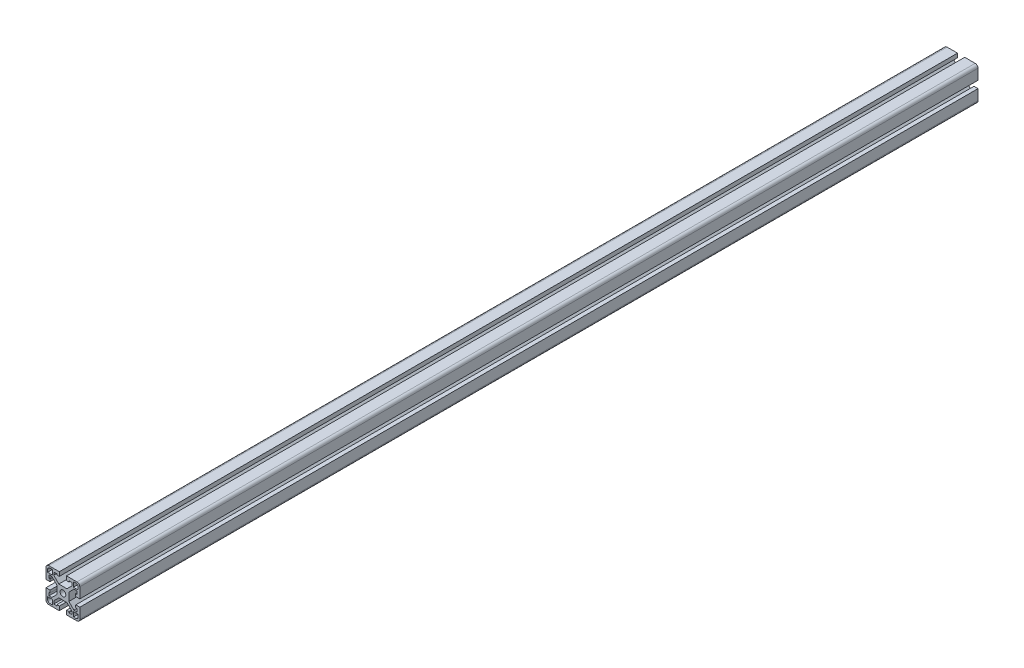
ISO-10303-21;
HEADER;
FILE_DESCRIPTION(('STEP AP214'),'2;1');
FILE_NAME('part.step','',(''),(''),'','','');
FILE_SCHEMA(('AUTOMOTIVE_DESIGN { 1 0 10303 214 1 1 1 1 }'));
ENDSEC;
DATA;
#1=APPLICATION_CONTEXT('core data for automotive mechanical design processes');
#2=APPLICATION_PROTOCOL_DEFINITION('international standard','automotive_design',2000,#1);
#3=PRODUCT_CONTEXT('',#1,'mechanical');
#4=PRODUCT('Part','Part','',(#3));
#5=PRODUCT_RELATED_PRODUCT_CATEGORY('part','',(#4));
#6=PRODUCT_DEFINITION_FORMATION('','',#4);
#7=PRODUCT_DEFINITION_CONTEXT('part definition',#1,'design');
#8=PRODUCT_DEFINITION('design','',#6,#7);
#9=PRODUCT_DEFINITION_SHAPE('','',#8);
#10=(LENGTH_UNIT() NAMED_UNIT(*) SI_UNIT(.MILLI.,.METRE.));
#11=(NAMED_UNIT(*) PLANE_ANGLE_UNIT() SI_UNIT($,.RADIAN.));
#12=(NAMED_UNIT(*) SI_UNIT($,.STERADIAN.) SOLID_ANGLE_UNIT());
#13=UNCERTAINTY_MEASURE_WITH_UNIT(LENGTH_MEASURE(1.E-05),#10,'distance_accuracy_value','');
#14=(GEOMETRIC_REPRESENTATION_CONTEXT(3) GLOBAL_UNCERTAINTY_ASSIGNED_CONTEXT((#13)) GLOBAL_UNIT_ASSIGNED_CONTEXT((#10,
#11,#12)) REPRESENTATION_CONTEXT('',''));
#15=CARTESIAN_POINT('',(0.,0.,0.));
#16=DIRECTION('',(0.,0.,1.));
#17=DIRECTION('',(1.,0.,0.));
#18=AXIS2_PLACEMENT_3D('',#15,#16,#17);
#19=CARTESIAN_POINT('',(-12.4422614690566,10.287,-1066.70653672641));
#20=DIRECTION('',(-0.707106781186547,-0.707106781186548,0.));
#21=DIRECTION('',(0.707106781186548,-0.707106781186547,0.));
#22=AXIS2_PLACEMENT_3D('',#19,#20,#21);
#23=PLANE('',#22);
#24=DIRECTION('',(0.,0.,1.));
#25=VECTOR('',#24,1.);
#26=CARTESIAN_POINT('',(-12.4422614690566,10.287,-1066.70653672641));
#27=LINE('',#26,#25);
#28=CARTESIAN_POINT('',(-12.4422614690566,10.287,-1012.825));
#29=VERTEX_POINT('',#28);
#30=CARTESIAN_POINT('',(-12.4422614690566,10.287,0.));
#31=VERTEX_POINT('',#30);
#32=EDGE_CURVE('E575',#29,#31,#27,.T.);
#33=ORIENTED_EDGE('',*,*,#32,.F.);
#34=DIRECTION('',(0.707106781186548,-0.707106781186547,0.));
#35=VECTOR('',#34,1.);
#36=CARTESIAN_POINT('',(-12.4422614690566,10.287,-1012.825));
#37=LINE('',#36,#35);
#38=CARTESIAN_POINT('',(-6.731,4.57573853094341,-1012.825));
#39=VERTEX_POINT('',#38);
#40=EDGE_CURVE('E757',#29,#39,#37,.T.);
#41=ORIENTED_EDGE('',*,*,#40,.T.);
#42=DIRECTION('',(0.,0.,1.));
#43=VECTOR('',#42,1.);
#44=CARTESIAN_POINT('',(-6.731,4.57573853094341,-1066.70653672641));
#45=LINE('',#44,#43);
#46=CARTESIAN_POINT('',(-6.731,4.57573853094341,0.));
#47=VERTEX_POINT('',#46);
#48=EDGE_CURVE('E755',#39,#47,#45,.T.);
#49=ORIENTED_EDGE('',*,*,#48,.T.);
#50=DIRECTION('',(0.707106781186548,-0.707106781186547,0.));
#51=VECTOR('',#50,1.);
#52=CARTESIAN_POINT('',(-12.4422614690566,10.287,0.));
#53=LINE('',#52,#51);
#54=EDGE_CURVE('E828',#31,#47,#53,.T.);
#55=ORIENTED_EDGE('',*,*,#54,.F.);
#56=EDGE_LOOP('',(#33,#41,#49,#55));
#57=FACE_BOUND('',#56,.T.);
#58=ADVANCED_FACE('F33',(#57),#23,.T.);
#59=CARTESIAN_POINT('',(-15.6718,10.2870000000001,-1066.70653672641));
#60=DIRECTION('',(0.,-1.,0.));
#61=DIRECTION('',(1.,0.,0.));
#62=AXIS2_PLACEMENT_3D('',#59,#60,#61);
#63=PLANE('',#62);
#64=DIRECTION('',(0.,0.,1.));
#65=VECTOR('',#64,1.);
#66=CARTESIAN_POINT('',(-15.6718,10.2870000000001,-1066.70653672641));
#67=LINE('',#66,#65);
#68=CARTESIAN_POINT('',(-15.6718,10.2870000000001,-1012.825));
#69=VERTEX_POINT('',#68);
#70=CARTESIAN_POINT('',(-15.6718,10.2870000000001,0.));
#71=VERTEX_POINT('',#70);
#72=EDGE_CURVE('E579',#69,#71,#67,.T.);
#73=ORIENTED_EDGE('',*,*,#72,.F.);
#74=DIRECTION('',(1.,0.,0.));
#75=VECTOR('',#74,1.);
#76=CARTESIAN_POINT('',(-15.6718,10.2870000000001,-1012.825));
#77=LINE('',#76,#75);
#78=EDGE_CURVE('E578',#69,#29,#77,.T.);
#79=ORIENTED_EDGE('',*,*,#78,.T.);
#80=ORIENTED_EDGE('',*,*,#32,.T.);
#81=DIRECTION('',(1.,0.,0.));
#82=VECTOR('',#81,1.);
#83=CARTESIAN_POINT('',(-15.6718,10.2870000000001,0.));
#84=LINE('',#83,#82);
#85=EDGE_CURVE('E837',#71,#31,#84,.T.);
#86=ORIENTED_EDGE('',*,*,#85,.F.);
#87=EDGE_LOOP('',(#73,#79,#80,#86));
#88=FACE_BOUND('',#87,.T.);
#89=ADVANCED_FACE('F1067',(#88),#63,.T.);
#90=CARTESIAN_POINT('',(-15.6718,6.85800000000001,-1066.70653672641));
#91=DIRECTION('',(1.,0.,0.));
#92=DIRECTION('',(0.,0.,-1.));
#93=AXIS2_PLACEMENT_3D('',#90,#91,#92);
#94=PLANE('',#93);
#95=DIRECTION('',(0.,0.,1.));
#96=VECTOR('',#95,1.);
#97=CARTESIAN_POINT('',(-15.6718,6.85800000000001,-1066.70653672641));
#98=LINE('',#97,#96);
#99=CARTESIAN_POINT('',(-15.6718,6.85800000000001,-1012.825));
#100=VERTEX_POINT('',#99);
#101=CARTESIAN_POINT('',(-15.6718,6.85800000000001,0.));
#102=VERTEX_POINT('',#101);
#103=EDGE_CURVE('E582',#100,#102,#98,.T.);
#104=ORIENTED_EDGE('',*,*,#103,.F.);
#105=DIRECTION('',(0.,1.,0.));
#106=VECTOR('',#105,1.);
#107=CARTESIAN_POINT('',(-15.6718,6.85799999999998,-1012.825));
#108=LINE('',#107,#106);
#109=EDGE_CURVE('E577',#100,#69,#108,.T.);
#110=ORIENTED_EDGE('',*,*,#109,.T.);
#111=ORIENTED_EDGE('',*,*,#72,.T.);
#112=DIRECTION('',(0.,1.,0.));
#113=VECTOR('',#112,1.);
#114=CARTESIAN_POINT('',(-15.6718,6.85800000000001,0.));
#115=LINE('',#114,#113);
#116=EDGE_CURVE('E1453',#102,#71,#115,.T.);
#117=ORIENTED_EDGE('',*,*,#116,.F.);
#118=EDGE_LOOP('',(#104,#110,#111,#117));
#119=FACE_BOUND('',#118,.T.);
#120=ADVANCED_FACE('F1073',(#119),#94,.T.);
#121=CARTESIAN_POINT('',(-14.478,6.85800000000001,-1066.70653672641));
#122=DIRECTION('',(0.,1.,0.));
#123=DIRECTION('',(0.,0.,1.));
#124=AXIS2_PLACEMENT_3D('',#121,#122,#123);
#125=PLANE('',#124);
#126=DIRECTION('',(0.,0.,1.));
#127=VECTOR('',#126,1.);
#128=CARTESIAN_POINT('',(-14.478,6.85800000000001,-1066.70653672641));
#129=LINE('',#128,#127);
#130=CARTESIAN_POINT('',(-14.478,6.85800000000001,-1012.825));
#131=VERTEX_POINT('',#130);
#132=CARTESIAN_POINT('',(-14.478,6.85800000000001,0.));
#133=VERTEX_POINT('',#132);
#134=EDGE_CURVE('E585',#131,#133,#129,.T.);
#135=ORIENTED_EDGE('',*,*,#134,.F.);
#136=DIRECTION('',(-1.,0.,0.));
#137=VECTOR('',#136,1.);
#138=CARTESIAN_POINT('',(-14.478,6.85800000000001,-1012.825));
#139=LINE('',#138,#137);
#140=EDGE_CURVE('E581',#131,#100,#139,.T.);
#141=ORIENTED_EDGE('',*,*,#140,.T.);
#142=ORIENTED_EDGE('',*,*,#103,.T.);
#143=DIRECTION('',(-1.,0.,0.));
#144=VECTOR('',#143,1.);
#145=CARTESIAN_POINT('',(-14.478,6.85800000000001,0.));
#146=LINE('',#145,#144);
#147=EDGE_CURVE('E1462',#133,#102,#146,.T.);
#148=ORIENTED_EDGE('',*,*,#147,.F.);
#149=EDGE_LOOP('',(#135,#141,#142,#148));
#150=FACE_BOUND('',#149,.T.);
#151=ADVANCED_FACE('F1442',(#150),#125,.T.);
#152=CARTESIAN_POINT('',(-14.478,4.06400000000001,-1066.70653672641));
#153=DIRECTION('',(1.,0.,0.));
#154=DIRECTION('',(0.,0.,-1.));
#155=AXIS2_PLACEMENT_3D('',#152,#153,#154);
#156=PLANE('',#155);
#157=DIRECTION('',(0.,0.,1.));
#158=VECTOR('',#157,1.);
#159=CARTESIAN_POINT('',(-14.478,4.06400000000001,-1066.70653672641));
#160=LINE('',#159,#158);
#161=CARTESIAN_POINT('',(-14.478,4.06400000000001,-1012.825));
#162=VERTEX_POINT('',#161);
#163=CARTESIAN_POINT('',(-14.478,4.06400000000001,0.));
#164=VERTEX_POINT('',#163);
#165=EDGE_CURVE('E588',#162,#164,#160,.T.);
#166=ORIENTED_EDGE('',*,*,#165,.F.);
#167=DIRECTION('',(0.,1.,0.));
#168=VECTOR('',#167,1.);
#169=CARTESIAN_POINT('',(-14.478,4.06399999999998,-1012.825));
#170=LINE('',#169,#168);
#171=EDGE_CURVE('E584',#162,#131,#170,.T.);
#172=ORIENTED_EDGE('',*,*,#171,.T.);
#173=ORIENTED_EDGE('',*,*,#134,.T.);
#174=DIRECTION('',(0.,1.,0.));
#175=VECTOR('',#174,1.);
#176=CARTESIAN_POINT('',(-14.478,4.06400000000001,0.));
#177=LINE('',#176,#175);
#178=EDGE_CURVE('E1465',#164,#133,#177,.T.);
#179=ORIENTED_EDGE('',*,*,#178,.F.);
#180=EDGE_LOOP('',(#166,#172,#173,#179));
#181=FACE_BOUND('',#180,.T.);
#182=ADVANCED_FACE('F1438',(#181),#156,.T.);
#183=CARTESIAN_POINT('',(-19.05,4.06400000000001,-1066.70653672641));
#184=DIRECTION('',(0.,-1.,0.));
#185=DIRECTION('',(1.,0.,0.));
#186=AXIS2_PLACEMENT_3D('',#183,#184,#185);
#187=PLANE('',#186);
#188=DIRECTION('',(0.,0.,1.));
#189=VECTOR('',#188,1.);
#190=CARTESIAN_POINT('',(-19.05,4.06400000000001,-1066.70653672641));
#191=LINE('',#190,#189);
#192=CARTESIAN_POINT('',(-19.05,4.06400000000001,-1012.825));
#193=VERTEX_POINT('',#192);
#194=CARTESIAN_POINT('',(-19.05,4.06400000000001,0.));
#195=VERTEX_POINT('',#194);
#196=EDGE_CURVE('E591',#193,#195,#191,.T.);
#197=ORIENTED_EDGE('',*,*,#196,.F.);
#198=DIRECTION('',(1.,0.,0.));
#199=VECTOR('',#198,1.);
#200=CARTESIAN_POINT('',(-19.05,4.06400000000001,-1012.825));
#201=LINE('',#200,#199);
#202=EDGE_CURVE('E587',#193,#162,#201,.T.);
#203=ORIENTED_EDGE('',*,*,#202,.T.);
#204=ORIENTED_EDGE('',*,*,#165,.T.);
#205=DIRECTION('',(1.,0.,0.));
#206=VECTOR('',#205,1.);
#207=CARTESIAN_POINT('',(-19.05,4.06400000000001,0.));
#208=LINE('',#207,#206);
#209=EDGE_CURVE('E1469',#195,#164,#208,.T.);
#210=ORIENTED_EDGE('',*,*,#209,.F.);
#211=EDGE_LOOP('',(#197,#203,#204,#210));
#212=FACE_BOUND('',#211,.T.);
#213=ADVANCED_FACE('F1434',(#212),#187,.T.);
#214=CARTESIAN_POINT('',(-19.05,15.875,-1066.70653672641));
#215=DIRECTION('',(-1.,0.,0.));
#216=DIRECTION('',(0.,-1.,0.));
#217=AXIS2_PLACEMENT_3D('',#214,#215,#216);
#218=PLANE('',#217);
#219=DIRECTION('',(0.,0.,1.));
#220=VECTOR('',#219,1.);
#221=CARTESIAN_POINT('',(-19.05,15.875,-1066.70653672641));
#222=LINE('',#221,#220);
#223=CARTESIAN_POINT('',(-19.05,15.875,-1012.825));
#224=VERTEX_POINT('',#223);
#225=CARTESIAN_POINT('',(-19.05,15.875,0.));
#226=VERTEX_POINT('',#225);
#227=EDGE_CURVE('E594',#224,#226,#222,.T.);
#228=ORIENTED_EDGE('',*,*,#227,.F.);
#229=DIRECTION('',(0.,-1.,0.));
#230=VECTOR('',#229,1.);
#231=CARTESIAN_POINT('',(-19.05,15.875,-1012.825));
#232=LINE('',#231,#230);
#233=EDGE_CURVE('E590',#224,#193,#232,.T.);
#234=ORIENTED_EDGE('',*,*,#233,.T.);
#235=ORIENTED_EDGE('',*,*,#196,.T.);
#236=DIRECTION('',(0.,-1.,0.));
#237=VECTOR('',#236,1.);
#238=CARTESIAN_POINT('',(-19.05,15.875,0.));
#239=LINE('',#238,#237);
#240=EDGE_CURVE('E1472',#226,#195,#239,.T.);
#241=ORIENTED_EDGE('',*,*,#240,.F.);
#242=EDGE_LOOP('',(#228,#234,#235,#241));
#243=FACE_BOUND('',#242,.T.);
#244=ADVANCED_FACE('F1430',(#243),#218,.T.);
#245=CARTESIAN_POINT('',(-15.875,15.875,-1066.70653672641));
#246=DIRECTION('',(0.,0.,1.));
#247=DIRECTION('',(1.,0.,0.));
#248=AXIS2_PLACEMENT_3D('',#245,#246,#247);
#249=CYLINDRICAL_SURFACE('',#248,3.17499999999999);
#250=DIRECTION('',(0.,0.,1.));
#251=VECTOR('',#250,1.);
#252=CARTESIAN_POINT('',(-15.875,19.05,-1066.70653672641));
#253=LINE('',#252,#251);
#254=CARTESIAN_POINT('',(-15.875,19.05,-1012.825));
#255=VERTEX_POINT('',#254);
#256=CARTESIAN_POINT('',(-15.875,19.05,0.));
#257=VERTEX_POINT('',#256);
#258=EDGE_CURVE('E597',#255,#257,#253,.T.);
#259=ORIENTED_EDGE('',*,*,#258,.F.);
#260=CARTESIAN_POINT('',(-15.875,15.875,-1012.825));
#261=DIRECTION('',(0.,0.,-1.));
#262=DIRECTION('',(0.,1.,0.));
#263=AXIS2_PLACEMENT_3D('',#260,#261,#262);
#264=CIRCLE('',#263,3.17499999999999);
#265=EDGE_CURVE('E593',#255,#224,#264,.F.);
#266=ORIENTED_EDGE('',*,*,#265,.T.);
#267=ORIENTED_EDGE('',*,*,#227,.T.);
#268=CARTESIAN_POINT('',(-15.875,15.875,0.));
#269=DIRECTION('',(0.,0.,1.));
#270=DIRECTION('',(1.,0.,0.));
#271=AXIS2_PLACEMENT_3D('',#268,#269,#270);
#272=CIRCLE('',#271,3.17499999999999);
#273=EDGE_CURVE('E1475',#257,#226,#272,.T.);
#274=ORIENTED_EDGE('',*,*,#273,.F.);
#275=EDGE_LOOP('',(#259,#266,#267,#274));
#276=FACE_BOUND('',#275,.T.);
#277=ADVANCED_FACE('F1426',(#276),#249,.T.);
#278=CARTESIAN_POINT('',(-4.06400000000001,19.05,-1066.70653672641));
#279=DIRECTION('',(0.,1.,0.));
#280=DIRECTION('',(-1.,0.,0.));
#281=AXIS2_PLACEMENT_3D('',#278,#279,#280);
#282=PLANE('',#281);
#283=DIRECTION('',(0.,0.,1.));
#284=VECTOR('',#283,1.);
#285=CARTESIAN_POINT('',(-4.06400000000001,19.05,-1066.70653672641));
#286=LINE('',#285,#284);
#287=CARTESIAN_POINT('',(-4.06400000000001,19.05,-1012.825));
#288=VERTEX_POINT('',#287);
#289=CARTESIAN_POINT('',(-4.06400000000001,19.05,0.));
#290=VERTEX_POINT('',#289);
#291=EDGE_CURVE('E600',#288,#290,#286,.T.);
#292=ORIENTED_EDGE('',*,*,#291,.F.);
#293=DIRECTION('',(-1.,0.,0.));
#294=VECTOR('',#293,1.);
#295=CARTESIAN_POINT('',(-4.06399999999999,19.05,-1012.825));
#296=LINE('',#295,#294);
#297=EDGE_CURVE('E596',#288,#255,#296,.T.);
#298=ORIENTED_EDGE('',*,*,#297,.T.);
#299=ORIENTED_EDGE('',*,*,#258,.T.);
#300=DIRECTION('',(-1.,0.,0.));
#301=VECTOR('',#300,1.);
#302=CARTESIAN_POINT('',(-4.06400000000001,19.05,0.));
#303=LINE('',#302,#301);
#304=EDGE_CURVE('E1478',#290,#257,#303,.T.);
#305=ORIENTED_EDGE('',*,*,#304,.F.);
#306=EDGE_LOOP('',(#292,#298,#299,#305));
#307=FACE_BOUND('',#306,.T.);
#308=ADVANCED_FACE('F1422',(#307),#282,.T.);
#309=CARTESIAN_POINT('',(-4.064,14.478,-1066.70653672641));
#310=DIRECTION('',(1.,0.,0.));
#311=DIRECTION('',(0.,1.,0.));
#312=AXIS2_PLACEMENT_3D('',#309,#310,#311);
#313=PLANE('',#312);
#314=DIRECTION('',(0.,0.,1.));
#315=VECTOR('',#314,1.);
#316=CARTESIAN_POINT('',(-4.064,14.478,-1066.70653672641));
#317=LINE('',#316,#315);
#318=CARTESIAN_POINT('',(-4.06400000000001,14.478,-1012.825));
#319=VERTEX_POINT('',#318);
#320=CARTESIAN_POINT('',(-4.064,14.478,0.));
#321=VERTEX_POINT('',#320);
#322=EDGE_CURVE('E603',#319,#321,#317,.T.);
#323=ORIENTED_EDGE('',*,*,#322,.F.);
#324=DIRECTION('',(0.,1.,0.));
#325=VECTOR('',#324,1.);
#326=CARTESIAN_POINT('',(-4.064,14.478,-1012.825));
#327=LINE('',#326,#325);
#328=EDGE_CURVE('E599',#319,#288,#327,.T.);
#329=ORIENTED_EDGE('',*,*,#328,.T.);
#330=ORIENTED_EDGE('',*,*,#291,.T.);
#331=DIRECTION('',(0.,1.,0.));
#332=VECTOR('',#331,1.);
#333=CARTESIAN_POINT('',(-4.064,14.478,0.));
#334=LINE('',#333,#332);
#335=EDGE_CURVE('E1481',#321,#290,#334,.T.);
#336=ORIENTED_EDGE('',*,*,#335,.F.);
#337=EDGE_LOOP('',(#323,#329,#330,#336));
#338=FACE_BOUND('',#337,.T.);
#339=ADVANCED_FACE('F1418',(#338),#313,.T.);
#340=CARTESIAN_POINT('',(-6.858,14.478,-1066.70653672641));
#341=DIRECTION('',(0.,-1.,0.));
#342=DIRECTION('',(0.,0.,-1.));
#343=AXIS2_PLACEMENT_3D('',#340,#341,#342);
#344=PLANE('',#343);
#345=DIRECTION('',(0.,0.,1.));
#346=VECTOR('',#345,1.);
#347=CARTESIAN_POINT('',(-6.858,14.478,-1066.70653672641));
#348=LINE('',#347,#346);
#349=CARTESIAN_POINT('',(-6.858,14.478,-1012.825));
#350=VERTEX_POINT('',#349);
#351=CARTESIAN_POINT('',(-6.858,14.478,0.));
#352=VERTEX_POINT('',#351);
#353=EDGE_CURVE('E606',#350,#352,#348,.T.);
#354=ORIENTED_EDGE('',*,*,#353,.F.);
#355=DIRECTION('',(1.,0.,0.));
#356=VECTOR('',#355,1.);
#357=CARTESIAN_POINT('',(-6.85799999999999,14.478,-1012.825));
#358=LINE('',#357,#356);
#359=EDGE_CURVE('E602',#350,#319,#358,.T.);
#360=ORIENTED_EDGE('',*,*,#359,.T.);
#361=ORIENTED_EDGE('',*,*,#322,.T.);
#362=DIRECTION('',(1.,0.,0.));
#363=VECTOR('',#362,1.);
#364=CARTESIAN_POINT('',(-6.858,14.478,0.));
#365=LINE('',#364,#363);
#366=EDGE_CURVE('E1484',#352,#321,#365,.T.);
#367=ORIENTED_EDGE('',*,*,#366,.F.);
#368=EDGE_LOOP('',(#354,#360,#361,#367));
#369=FACE_BOUND('',#368,.T.);
#370=ADVANCED_FACE('F1414',(#369),#344,.T.);
#371=CARTESIAN_POINT('',(-6.858,15.6718,-1066.70653672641));
#372=DIRECTION('',(-1.,0.,0.));
#373=DIRECTION('',(0.,0.,1.));
#374=AXIS2_PLACEMENT_3D('',#371,#372,#373);
#375=PLANE('',#374);
#376=DIRECTION('',(0.,0.,1.));
#377=VECTOR('',#376,1.);
#378=CARTESIAN_POINT('',(-6.858,15.6718,-1066.70653672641));
#379=LINE('',#378,#377);
#380=CARTESIAN_POINT('',(-6.858,15.6718,-1012.825));
#381=VERTEX_POINT('',#380);
#382=CARTESIAN_POINT('',(-6.858,15.6718,0.));
#383=VERTEX_POINT('',#382);
#384=EDGE_CURVE('E609',#381,#383,#379,.T.);
#385=ORIENTED_EDGE('',*,*,#384,.F.);
#386=DIRECTION('',(0.,-1.,0.));
#387=VECTOR('',#386,1.);
#388=CARTESIAN_POINT('',(-6.858,15.6717999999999,-1012.825));
#389=LINE('',#388,#387);
#390=EDGE_CURVE('E605',#381,#350,#389,.T.);
#391=ORIENTED_EDGE('',*,*,#390,.T.);
#392=ORIENTED_EDGE('',*,*,#353,.T.);
#393=DIRECTION('',(0.,-1.,0.));
#394=VECTOR('',#393,1.);
#395=CARTESIAN_POINT('',(-6.858,15.6718,0.));
#396=LINE('',#395,#394);
#397=EDGE_CURVE('E1487',#383,#352,#396,.T.);
#398=ORIENTED_EDGE('',*,*,#397,.F.);
#399=EDGE_LOOP('',(#385,#391,#392,#398));
#400=FACE_BOUND('',#399,.T.);
#401=ADVANCED_FACE('F1410',(#400),#375,.T.);
#402=CARTESIAN_POINT('',(-10.287,15.6718,-1066.70653672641));
#403=DIRECTION('',(0.,-1.,0.));
#404=DIRECTION('',(0.,0.,-1.));
#405=AXIS2_PLACEMENT_3D('',#402,#403,#404);
#406=PLANE('',#405);
#407=DIRECTION('',(0.,0.,1.));
#408=VECTOR('',#407,1.);
#409=CARTESIAN_POINT('',(-10.287,15.6718,-1066.70653672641));
#410=LINE('',#409,#408);
#411=CARTESIAN_POINT('',(-10.287,15.6718,-1012.825));
#412=VERTEX_POINT('',#411);
#413=CARTESIAN_POINT('',(-10.287,15.6718,0.));
#414=VERTEX_POINT('',#413);
#415=EDGE_CURVE('E612',#412,#414,#410,.T.);
#416=ORIENTED_EDGE('',*,*,#415,.F.);
#417=DIRECTION('',(1.,0.,0.));
#418=VECTOR('',#417,1.);
#419=CARTESIAN_POINT('',(-10.287,15.6718,-1012.825));
#420=LINE('',#419,#418);
#421=EDGE_CURVE('E608',#412,#381,#420,.T.);
#422=ORIENTED_EDGE('',*,*,#421,.T.);
#423=ORIENTED_EDGE('',*,*,#384,.T.);
#424=DIRECTION('',(1.,0.,0.));
#425=VECTOR('',#424,1.);
#426=CARTESIAN_POINT('',(-10.287,15.6718,0.));
#427=LINE('',#426,#425);
#428=EDGE_CURVE('E1490',#414,#383,#427,.T.);
#429=ORIENTED_EDGE('',*,*,#428,.F.);
#430=EDGE_LOOP('',(#416,#422,#423,#429));
#431=FACE_BOUND('',#430,.T.);
#432=ADVANCED_FACE('F1406',(#431),#406,.T.);
#433=CARTESIAN_POINT('',(-10.287,12.4422614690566,-1066.70653672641));
#434=DIRECTION('',(1.,0.,0.));
#435=DIRECTION('',(0.,1.,0.));
#436=AXIS2_PLACEMENT_3D('',#433,#434,#435);
#437=PLANE('',#436);
#438=DIRECTION('',(0.,0.,1.));
#439=VECTOR('',#438,1.);
#440=CARTESIAN_POINT('',(-10.287,12.4422614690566,-1066.70653672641));
#441=LINE('',#440,#439);
#442=CARTESIAN_POINT('',(-10.287,12.4422614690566,-1012.825));
#443=VERTEX_POINT('',#442);
#444=CARTESIAN_POINT('',(-10.287,12.4422614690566,0.));
#445=VERTEX_POINT('',#444);
#446=EDGE_CURVE('E615',#443,#445,#441,.T.);
#447=ORIENTED_EDGE('',*,*,#446,.F.);
#448=DIRECTION('',(0.,1.,0.));
#449=VECTOR('',#448,1.);
#450=CARTESIAN_POINT('',(-10.287,12.4422614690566,-1012.825));
#451=LINE('',#450,#449);
#452=EDGE_CURVE('E611',#443,#412,#451,.T.);
#453=ORIENTED_EDGE('',*,*,#452,.T.);
#454=ORIENTED_EDGE('',*,*,#415,.T.);
#455=DIRECTION('',(0.,1.,0.));
#456=VECTOR('',#455,1.);
#457=CARTESIAN_POINT('',(-10.287,12.4422614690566,0.));
#458=LINE('',#457,#456);
#459=EDGE_CURVE('E1493',#445,#414,#458,.T.);
#460=ORIENTED_EDGE('',*,*,#459,.F.);
#461=EDGE_LOOP('',(#447,#453,#454,#460));
#462=FACE_BOUND('',#461,.T.);
#463=ADVANCED_FACE('F1402',(#462),#437,.T.);
#464=CARTESIAN_POINT('',(-4.57573853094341,6.73100000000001,-1066.70653672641));
#465=DIRECTION('',(0.707106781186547,0.707106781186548,0.));
#466=DIRECTION('',(-0.707106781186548,0.707106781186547,0.));
#467=AXIS2_PLACEMENT_3D('',#464,#465,#466);
#468=PLANE('',#467);
#469=DIRECTION('',(0.,0.,1.));
#470=VECTOR('',#469,1.);
#471=CARTESIAN_POINT('',(-4.57573853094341,6.73100000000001,-1066.70653672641));
#472=LINE('',#471,#470);
#473=CARTESIAN_POINT('',(-4.57573853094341,6.73100000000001,-1012.825));
#474=VERTEX_POINT('',#473);
#475=CARTESIAN_POINT('',(-4.57573853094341,6.73100000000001,0.));
#476=VERTEX_POINT('',#475);
#477=EDGE_CURVE('E618',#474,#476,#472,.T.);
#478=ORIENTED_EDGE('',*,*,#477,.F.);
#479=DIRECTION('',(-0.707106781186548,0.707106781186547,0.));
#480=VECTOR('',#479,1.);
#481=CARTESIAN_POINT('',(-4.57573853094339,6.73099999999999,-1012.825));
#482=LINE('',#481,#480);
#483=EDGE_CURVE('E614',#474,#443,#482,.T.);
#484=ORIENTED_EDGE('',*,*,#483,.T.);
#485=ORIENTED_EDGE('',*,*,#446,.T.);
#486=DIRECTION('',(-0.707106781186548,0.707106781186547,0.));
#487=VECTOR('',#486,1.);
#488=CARTESIAN_POINT('',(-4.57573853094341,6.73100000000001,0.));
#489=LINE('',#488,#487);
#490=EDGE_CURVE('E1496',#476,#445,#489,.T.);
#491=ORIENTED_EDGE('',*,*,#490,.F.);
#492=EDGE_LOOP('',(#478,#484,#485,#491));
#493=FACE_BOUND('',#492,.T.);
#494=ADVANCED_FACE('F1398',(#493),#468,.T.);
#495=CARTESIAN_POINT('',(4.57573853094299,6.73100000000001,-1066.70653672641));
#496=DIRECTION('',(0.,1.,0.));
#497=DIRECTION('',(0.,0.,1.));
#498=AXIS2_PLACEMENT_3D('',#495,#496,#497);
#499=PLANE('',#498);
#500=DIRECTION('',(0.,0.,1.));
#501=VECTOR('',#500,1.);
#502=CARTESIAN_POINT('',(4.57573853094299,6.73100000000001,-1066.70653672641));
#503=LINE('',#502,#501);
#504=CARTESIAN_POINT('',(4.57573853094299,6.73100000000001,-1012.825));
#505=VERTEX_POINT('',#504);
#506=CARTESIAN_POINT('',(4.57573853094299,6.73100000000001,0.));
#507=VERTEX_POINT('',#506);
#508=EDGE_CURVE('E621',#505,#507,#503,.T.);
#509=ORIENTED_EDGE('',*,*,#508,.F.);
#510=DIRECTION('',(-1.,0.,0.));
#511=VECTOR('',#510,1.);
#512=CARTESIAN_POINT('',(4.57573853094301,6.73100000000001,-1012.825));
#513=LINE('',#512,#511);
#514=EDGE_CURVE('E617',#505,#474,#513,.T.);
#515=ORIENTED_EDGE('',*,*,#514,.T.);
#516=ORIENTED_EDGE('',*,*,#477,.T.);
#517=DIRECTION('',(-1.,0.,0.));
#518=VECTOR('',#517,1.);
#519=CARTESIAN_POINT('',(4.57573853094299,6.73100000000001,0.));
#520=LINE('',#519,#518);
#521=EDGE_CURVE('E1499',#507,#476,#520,.T.);
#522=ORIENTED_EDGE('',*,*,#521,.F.);
#523=EDGE_LOOP('',(#509,#515,#516,#522));
#524=FACE_BOUND('',#523,.T.);
#525=ADVANCED_FACE('F1394',(#524),#499,.T.);
#526=CARTESIAN_POINT('',(10.2869999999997,12.4422614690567,-1066.70653672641));
#527=DIRECTION('',(-0.707106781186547,0.707106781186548,0.));
#528=DIRECTION('',(-0.707106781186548,-0.707106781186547,0.));
#529=AXIS2_PLACEMENT_3D('',#526,#527,#528);
#530=PLANE('',#529);
#531=DIRECTION('',(0.,0.,1.));
#532=VECTOR('',#531,1.);
#533=CARTESIAN_POINT('',(10.2869999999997,12.4422614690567,-1066.70653672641));
#534=LINE('',#533,#532);
#535=CARTESIAN_POINT('',(10.2869999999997,12.4422614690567,-1012.825));
#536=VERTEX_POINT('',#535);
#537=CARTESIAN_POINT('',(10.2869999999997,12.4422614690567,0.));
#538=VERTEX_POINT('',#537);
#539=EDGE_CURVE('E624',#536,#538,#534,.T.);
#540=ORIENTED_EDGE('',*,*,#539,.F.);
#541=DIRECTION('',(-0.707106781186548,-0.707106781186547,0.));
#542=VECTOR('',#541,1.);
#543=CARTESIAN_POINT('',(10.2869999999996,12.4422614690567,-1012.825));
#544=LINE('',#543,#542);
#545=EDGE_CURVE('E620',#536,#505,#544,.T.);
#546=ORIENTED_EDGE('',*,*,#545,.T.);
#547=ORIENTED_EDGE('',*,*,#508,.T.);
#548=DIRECTION('',(-0.707106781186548,-0.707106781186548,0.));
#549=VECTOR('',#548,1.);
#550=CARTESIAN_POINT('',(10.2869999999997,12.4422614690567,0.));
#551=LINE('',#550,#549);
#552=EDGE_CURVE('E1502',#538,#507,#551,.T.);
#553=ORIENTED_EDGE('',*,*,#552,.F.);
#554=EDGE_LOOP('',(#540,#546,#547,#553));
#555=FACE_BOUND('',#554,.T.);
#556=ADVANCED_FACE('F1390',(#555),#530,.T.);
#557=CARTESIAN_POINT('',(10.2869999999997,15.6718000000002,-1066.70653672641));
#558=DIRECTION('',(-1.,0.,0.));
#559=DIRECTION('',(0.,-1.,0.));
#560=AXIS2_PLACEMENT_3D('',#557,#558,#559);
#561=PLANE('',#560);
#562=DIRECTION('',(0.,0.,1.));
#563=VECTOR('',#562,1.);
#564=CARTESIAN_POINT('',(10.2869999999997,15.6718000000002,-1066.70653672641));
#565=LINE('',#564,#563);
#566=CARTESIAN_POINT('',(10.2869999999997,15.6718000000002,-1012.825));
#567=VERTEX_POINT('',#566);
#568=CARTESIAN_POINT('',(10.2869999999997,15.6718000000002,0.));
#569=VERTEX_POINT('',#568);
#570=EDGE_CURVE('E627',#567,#569,#565,.T.);
#571=ORIENTED_EDGE('',*,*,#570,.F.);
#572=DIRECTION('',(0.,-1.,0.));
#573=VECTOR('',#572,1.);
#574=CARTESIAN_POINT('',(10.2869999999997,15.6718000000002,-1012.825));
#575=LINE('',#574,#573);
#576=EDGE_CURVE('E623',#567,#536,#575,.T.);
#577=ORIENTED_EDGE('',*,*,#576,.T.);
#578=ORIENTED_EDGE('',*,*,#539,.T.);
#579=DIRECTION('',(0.,-1.,0.));
#580=VECTOR('',#579,1.);
#581=CARTESIAN_POINT('',(10.2869999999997,15.6718000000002,0.));
#582=LINE('',#581,#580);
#583=EDGE_CURVE('E1505',#569,#538,#582,.T.);
#584=ORIENTED_EDGE('',*,*,#583,.F.);
#585=EDGE_LOOP('',(#571,#577,#578,#584));
#586=FACE_BOUND('',#585,.T.);
#587=ADVANCED_FACE('F1386',(#586),#561,.T.);
#588=CARTESIAN_POINT('',(6.85799999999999,15.6718000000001,-1066.70653672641));
#589=DIRECTION('',(0.,-1.,0.));
#590=DIRECTION('',(1.,0.,0.));
#591=AXIS2_PLACEMENT_3D('',#588,#589,#590);
#592=PLANE('',#591);
#593=DIRECTION('',(0.,0.,1.));
#594=VECTOR('',#593,1.);
#595=CARTESIAN_POINT('',(6.85799999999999,15.6718000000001,-1066.70653672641));
#596=LINE('',#595,#594);
#597=CARTESIAN_POINT('',(6.85799999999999,15.6718000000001,-1012.825));
#598=VERTEX_POINT('',#597);
#599=CARTESIAN_POINT('',(6.85799999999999,15.6718000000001,0.));
#600=VERTEX_POINT('',#599);
#601=EDGE_CURVE('E630',#598,#600,#596,.T.);
#602=ORIENTED_EDGE('',*,*,#601,.F.);
#603=DIRECTION('',(1.,0.,0.));
#604=VECTOR('',#603,1.);
#605=CARTESIAN_POINT('',(6.858,15.6718000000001,-1012.825));
#606=LINE('',#605,#604);
#607=EDGE_CURVE('E626',#598,#567,#606,.T.);
#608=ORIENTED_EDGE('',*,*,#607,.T.);
#609=ORIENTED_EDGE('',*,*,#570,.T.);
#610=DIRECTION('',(1.,0.,0.));
#611=VECTOR('',#610,1.);
#612=CARTESIAN_POINT('',(6.85799999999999,15.6718000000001,0.));
#613=LINE('',#612,#611);
#614=EDGE_CURVE('E1508',#600,#569,#613,.T.);
#615=ORIENTED_EDGE('',*,*,#614,.F.);
#616=EDGE_LOOP('',(#602,#608,#609,#615));
#617=FACE_BOUND('',#616,.T.);
#618=ADVANCED_FACE('F1382',(#617),#592,.T.);
#619=CARTESIAN_POINT('',(6.85799999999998,14.478,-1066.70653672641));
#620=DIRECTION('',(1.,0.,0.));
#621=DIRECTION('',(0.,1.,0.));
#622=AXIS2_PLACEMENT_3D('',#619,#620,#621);
#623=PLANE('',#622);
#624=DIRECTION('',(0.,0.,1.));
#625=VECTOR('',#624,1.);
#626=CARTESIAN_POINT('',(6.85799999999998,14.478,-1066.70653672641));
#627=LINE('',#626,#625);
#628=CARTESIAN_POINT('',(6.85799999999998,14.478,-1012.825));
#629=VERTEX_POINT('',#628);
#630=CARTESIAN_POINT('',(6.85799999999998,14.478,0.));
#631=VERTEX_POINT('',#630);
#632=EDGE_CURVE('E633',#629,#631,#627,.T.);
#633=ORIENTED_EDGE('',*,*,#632,.F.);
#634=DIRECTION('',(0.,1.,0.));
#635=VECTOR('',#634,1.);
#636=CARTESIAN_POINT('',(6.85799999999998,14.478,-1012.825));
#637=LINE('',#636,#635);
#638=EDGE_CURVE('E629',#629,#598,#637,.T.);
#639=ORIENTED_EDGE('',*,*,#638,.T.);
#640=ORIENTED_EDGE('',*,*,#601,.T.);
#641=DIRECTION('',(0.,1.,0.));
#642=VECTOR('',#641,1.);
#643=CARTESIAN_POINT('',(6.85799999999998,14.478,0.));
#644=LINE('',#643,#642);
#645=EDGE_CURVE('E1511',#631,#600,#644,.T.);
#646=ORIENTED_EDGE('',*,*,#645,.F.);
#647=EDGE_LOOP('',(#633,#639,#640,#646));
#648=FACE_BOUND('',#647,.T.);
#649=ADVANCED_FACE('F1378',(#648),#623,.T.);
#650=CARTESIAN_POINT('',(4.06399999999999,14.478,-1066.70653672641));
#651=DIRECTION('',(0.,-1.,0.));
#652=DIRECTION('',(1.,0.,0.));
#653=AXIS2_PLACEMENT_3D('',#650,#651,#652);
#654=PLANE('',#653);
#655=DIRECTION('',(0.,0.,1.));
#656=VECTOR('',#655,1.);
#657=CARTESIAN_POINT('',(4.06399999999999,14.478,-1066.70653672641));
#658=LINE('',#657,#656);
#659=CARTESIAN_POINT('',(4.06399999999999,14.478,-1012.825));
#660=VERTEX_POINT('',#659);
#661=CARTESIAN_POINT('',(4.06399999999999,14.478,0.));
#662=VERTEX_POINT('',#661);
#663=EDGE_CURVE('E636',#660,#662,#658,.T.);
#664=ORIENTED_EDGE('',*,*,#663,.F.);
#665=DIRECTION('',(1.,0.,0.));
#666=VECTOR('',#665,1.);
#667=CARTESIAN_POINT('',(4.06400000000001,14.478,-1012.825));
#668=LINE('',#667,#666);
#669=EDGE_CURVE('E632',#660,#629,#668,.T.);
#670=ORIENTED_EDGE('',*,*,#669,.T.);
#671=ORIENTED_EDGE('',*,*,#632,.T.);
#672=DIRECTION('',(1.,0.,0.));
#673=VECTOR('',#672,1.);
#674=CARTESIAN_POINT('',(4.06399999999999,14.478,0.));
#675=LINE('',#674,#673);
#676=EDGE_CURVE('E1514',#662,#631,#675,.T.);
#677=ORIENTED_EDGE('',*,*,#676,.F.);
#678=EDGE_LOOP('',(#664,#670,#671,#677));
#679=FACE_BOUND('',#678,.T.);
#680=ADVANCED_FACE('F1374',(#679),#654,.T.);
#681=CARTESIAN_POINT('',(4.06399999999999,19.05,-1066.70653672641));
#682=DIRECTION('',(-1.,0.,0.));
#683=DIRECTION('',(0.,0.,1.));
#684=AXIS2_PLACEMENT_3D('',#681,#682,#683);
#685=PLANE('',#684);
#686=DIRECTION('',(0.,0.,1.));
#687=VECTOR('',#686,1.);
#688=CARTESIAN_POINT('',(4.06399999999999,19.05,-1066.70653672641));
#689=LINE('',#688,#687);
#690=CARTESIAN_POINT('',(4.06399999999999,19.05,-1012.825));
#691=VERTEX_POINT('',#690);
#692=CARTESIAN_POINT('',(4.06399999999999,19.05,0.));
#693=VERTEX_POINT('',#692);
#694=EDGE_CURVE('E639',#691,#693,#689,.T.);
#695=ORIENTED_EDGE('',*,*,#694,.F.);
#696=DIRECTION('',(0.,-1.,0.));
#697=VECTOR('',#696,1.);
#698=CARTESIAN_POINT('',(4.06399999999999,19.05,-1012.825));
#699=LINE('',#698,#697);
#700=EDGE_CURVE('E635',#691,#660,#699,.T.);
#701=ORIENTED_EDGE('',*,*,#700,.T.);
#702=ORIENTED_EDGE('',*,*,#663,.T.);
#703=DIRECTION('',(0.,-1.,0.));
#704=VECTOR('',#703,1.);
#705=CARTESIAN_POINT('',(4.06399999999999,19.05,0.));
#706=LINE('',#705,#704);
#707=EDGE_CURVE('E1517',#693,#662,#706,.T.);
#708=ORIENTED_EDGE('',*,*,#707,.F.);
#709=EDGE_LOOP('',(#695,#701,#702,#708));
#710=FACE_BOUND('',#709,.T.);
#711=ADVANCED_FACE('F1370',(#710),#685,.T.);
#712=CARTESIAN_POINT('',(15.875,19.05,-1066.70653672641));
#713=DIRECTION('',(0.,1.,0.));
#714=DIRECTION('',(-1.,0.,0.));
#715=AXIS2_PLACEMENT_3D('',#712,#713,#714);
#716=PLANE('',#715);
#717=DIRECTION('',(0.,0.,1.));
#718=VECTOR('',#717,1.);
#719=CARTESIAN_POINT('',(15.875,19.05,-1066.70653672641));
#720=LINE('',#719,#718);
#721=CARTESIAN_POINT('',(15.8750000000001,19.05,-1012.825));
#722=VERTEX_POINT('',#721);
#723=CARTESIAN_POINT('',(15.875,19.05,0.));
#724=VERTEX_POINT('',#723);
#725=EDGE_CURVE('E642',#722,#724,#720,.T.);
#726=ORIENTED_EDGE('',*,*,#725,.F.);
#727=DIRECTION('',(-1.,0.,0.));
#728=VECTOR('',#727,1.);
#729=CARTESIAN_POINT('',(15.875,19.05,-1012.825));
#730=LINE('',#729,#728);
#731=EDGE_CURVE('E638',#722,#691,#730,.T.);
#732=ORIENTED_EDGE('',*,*,#731,.T.);
#733=ORIENTED_EDGE('',*,*,#694,.T.);
#734=DIRECTION('',(-1.,0.,0.));
#735=VECTOR('',#734,1.);
#736=CARTESIAN_POINT('',(15.875,19.05,0.));
#737=LINE('',#736,#735);
#738=EDGE_CURVE('E1520',#724,#693,#737,.T.);
#739=ORIENTED_EDGE('',*,*,#738,.F.);
#740=EDGE_LOOP('',(#726,#732,#733,#739));
#741=FACE_BOUND('',#740,.T.);
#742=ADVANCED_FACE('F1366',(#741),#716,.T.);
#743=CARTESIAN_POINT('',(15.8750000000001,15.8750000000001,-1066.70653672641));
#744=DIRECTION('',(0.,0.,1.));
#745=DIRECTION('',(1.,0.,0.));
#746=AXIS2_PLACEMENT_3D('',#743,#744,#745);
#747=CYLINDRICAL_SURFACE('',#746,3.17499999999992);
#748=DIRECTION('',(0.,0.,1.));
#749=VECTOR('',#748,1.);
#750=CARTESIAN_POINT('',(19.05,15.8750000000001,-1066.70653672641));
#751=LINE('',#750,#749);
#752=CARTESIAN_POINT('',(19.05,15.8750000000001,-1012.825));
#753=VERTEX_POINT('',#752);
#754=CARTESIAN_POINT('',(19.05,15.8750000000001,0.));
#755=VERTEX_POINT('',#754);
#756=EDGE_CURVE('E645',#753,#755,#751,.T.);
#757=ORIENTED_EDGE('',*,*,#756,.F.);
#758=CARTESIAN_POINT('',(15.8750000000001,15.8750000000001,-1012.825));
#759=DIRECTION('',(0.,0.,-1.));
#760=DIRECTION('',(0.,1.,0.));
#761=AXIS2_PLACEMENT_3D('',#758,#759,#760);
#762=CIRCLE('',#761,3.17499999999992);
#763=EDGE_CURVE('E641',#753,#722,#762,.F.);
#764=ORIENTED_EDGE('',*,*,#763,.T.);
#765=ORIENTED_EDGE('',*,*,#725,.T.);
#766=CARTESIAN_POINT('',(15.8750000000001,15.8750000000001,0.));
#767=DIRECTION('',(0.,0.,1.));
#768=DIRECTION('',(1.,0.,0.));
#769=AXIS2_PLACEMENT_3D('',#766,#767,#768);
#770=CIRCLE('',#769,3.17499999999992);
#771=EDGE_CURVE('E1523',#755,#724,#770,.T.);
#772=ORIENTED_EDGE('',*,*,#771,.F.);
#773=EDGE_LOOP('',(#757,#764,#765,#772));
#774=FACE_BOUND('',#773,.T.);
#775=ADVANCED_FACE('F1362',(#774),#747,.T.);
#776=CARTESIAN_POINT('',(19.05,4.06399999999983,-1066.70653672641));
#777=DIRECTION('',(1.,0.,0.));
#778=DIRECTION('',(0.,1.,0.));
#779=AXIS2_PLACEMENT_3D('',#776,#777,#778);
#780=PLANE('',#779);
#781=DIRECTION('',(0.,0.,1.));
#782=VECTOR('',#781,1.);
#783=CARTESIAN_POINT('',(19.05,4.06399999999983,-1066.70653672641));
#784=LINE('',#783,#782);
#785=CARTESIAN_POINT('',(19.05,4.06399999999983,-1012.825));
#786=VERTEX_POINT('',#785);
#787=CARTESIAN_POINT('',(19.05,4.06399999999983,0.));
#788=VERTEX_POINT('',#787);
#789=EDGE_CURVE('E648',#786,#788,#784,.T.);
#790=ORIENTED_EDGE('',*,*,#789,.F.);
#791=DIRECTION('',(0.,1.,0.));
#792=VECTOR('',#791,1.);
#793=CARTESIAN_POINT('',(19.05,4.06399999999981,-1012.825));
#794=LINE('',#793,#792);
#795=EDGE_CURVE('E644',#786,#753,#794,.T.);
#796=ORIENTED_EDGE('',*,*,#795,.T.);
#797=ORIENTED_EDGE('',*,*,#756,.T.);
#798=DIRECTION('',(0.,1.,0.));
#799=VECTOR('',#798,1.);
#800=CARTESIAN_POINT('',(19.05,4.06399999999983,0.));
#801=LINE('',#800,#799);
#802=EDGE_CURVE('E1526',#788,#755,#801,.T.);
#803=ORIENTED_EDGE('',*,*,#802,.F.);
#804=EDGE_LOOP('',(#790,#796,#797,#803));
#805=FACE_BOUND('',#804,.T.);
#806=ADVANCED_FACE('F1358',(#805),#780,.T.);
#807=CARTESIAN_POINT('',(14.4780000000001,4.06399999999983,-1066.70653672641));
#808=DIRECTION('',(0.,-1.,0.));
#809=DIRECTION('',(0.,0.,-1.));
#810=AXIS2_PLACEMENT_3D('',#807,#808,#809);
#811=PLANE('',#810);
#812=DIRECTION('',(0.,0.,1.));
#813=VECTOR('',#812,1.);
#814=CARTESIAN_POINT('',(14.4780000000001,4.06399999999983,-1066.70653672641));
#815=LINE('',#814,#813);
#816=CARTESIAN_POINT('',(14.4780000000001,4.06399999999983,-1012.825));
#817=VERTEX_POINT('',#816);
#818=CARTESIAN_POINT('',(14.4780000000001,4.06399999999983,0.));
#819=VERTEX_POINT('',#818);
#820=EDGE_CURVE('E651',#817,#819,#815,.T.);
#821=ORIENTED_EDGE('',*,*,#820,.F.);
#822=DIRECTION('',(1.,0.,0.));
#823=VECTOR('',#822,1.);
#824=CARTESIAN_POINT('',(14.4780000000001,4.06399999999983,-1012.825));
#825=LINE('',#824,#823);
#826=EDGE_CURVE('E647',#817,#786,#825,.T.);
#827=ORIENTED_EDGE('',*,*,#826,.T.);
#828=ORIENTED_EDGE('',*,*,#789,.T.);
#829=DIRECTION('',(1.,0.,0.));
#830=VECTOR('',#829,1.);
#831=CARTESIAN_POINT('',(14.4780000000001,4.06399999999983,0.));
#832=LINE('',#831,#830);
#833=EDGE_CURVE('E1529',#819,#788,#832,.T.);
#834=ORIENTED_EDGE('',*,*,#833,.F.);
#835=EDGE_LOOP('',(#821,#827,#828,#834));
#836=FACE_BOUND('',#835,.T.);
#837=ADVANCED_FACE('F1354',(#836),#811,.T.);
#838=CARTESIAN_POINT('',(14.4780000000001,6.85799999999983,-1066.70653672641));
#839=DIRECTION('',(-1.,0.,0.));
#840=DIRECTION('',(0.,0.,1.));
#841=AXIS2_PLACEMENT_3D('',#838,#839,#840);
#842=PLANE('',#841);
#843=DIRECTION('',(0.,0.,1.));
#844=VECTOR('',#843,1.);
#845=CARTESIAN_POINT('',(14.4780000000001,6.85799999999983,-1066.70653672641));
#846=LINE('',#845,#844);
#847=CARTESIAN_POINT('',(14.4780000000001,6.85799999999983,-1012.825));
#848=VERTEX_POINT('',#847);
#849=CARTESIAN_POINT('',(14.4780000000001,6.85799999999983,0.));
#850=VERTEX_POINT('',#849);
#851=EDGE_CURVE('E654',#848,#850,#846,.T.);
#852=ORIENTED_EDGE('',*,*,#851,.F.);
#853=DIRECTION('',(0.,-1.,0.));
#854=VECTOR('',#853,1.);
#855=CARTESIAN_POINT('',(14.4780000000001,6.8579999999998,-1012.825));
#856=LINE('',#855,#854);
#857=EDGE_CURVE('E650',#848,#817,#856,.T.);
#858=ORIENTED_EDGE('',*,*,#857,.T.);
#859=ORIENTED_EDGE('',*,*,#820,.T.);
#860=DIRECTION('',(0.,-1.,0.));
#861=VECTOR('',#860,1.);
#862=CARTESIAN_POINT('',(14.4780000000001,6.85799999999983,0.));
#863=LINE('',#862,#861);
#864=EDGE_CURVE('E1532',#850,#819,#863,.T.);
#865=ORIENTED_EDGE('',*,*,#864,.F.);
#866=EDGE_LOOP('',(#852,#858,#859,#865));
#867=FACE_BOUND('',#866,.T.);
#868=ADVANCED_FACE('F1350',(#867),#842,.T.);
#869=CARTESIAN_POINT('',(15.6718,6.858,-1066.70653672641));
#870=DIRECTION('',(-1.48217284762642E-13,1.,0.));
#871=DIRECTION('',(-1.,-1.48217284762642E-13,0.));
#872=AXIS2_PLACEMENT_3D('',#869,#870,#871);
#873=PLANE('',#872);
#874=DIRECTION('',(0.,0.,1.));
#875=VECTOR('',#874,1.);
#876=CARTESIAN_POINT('',(15.6718,6.858,-1066.70653672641));
#877=LINE('',#876,#875);
#878=CARTESIAN_POINT('',(15.6718,6.858,-1012.825));
#879=VERTEX_POINT('',#878);
#880=CARTESIAN_POINT('',(15.6718,6.858,0.));
#881=VERTEX_POINT('',#880);
#882=EDGE_CURVE('E657',#879,#881,#877,.T.);
#883=ORIENTED_EDGE('',*,*,#882,.F.);
#884=DIRECTION('',(-1.,-1.48217284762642E-13,0.));
#885=VECTOR('',#884,1.);
#886=CARTESIAN_POINT('',(15.6718,6.858,-1012.825));
#887=LINE('',#886,#885);
#888=EDGE_CURVE('E653',#879,#848,#887,.T.);
#889=ORIENTED_EDGE('',*,*,#888,.T.);
#890=ORIENTED_EDGE('',*,*,#851,.T.);
#891=DIRECTION('',(-1.,-1.48217284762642E-13,0.));
#892=VECTOR('',#891,1.);
#893=CARTESIAN_POINT('',(15.6718,6.858,0.));
#894=LINE('',#893,#892);
#895=EDGE_CURVE('E1535',#881,#850,#894,.T.);
#896=ORIENTED_EDGE('',*,*,#895,.F.);
#897=EDGE_LOOP('',(#883,#889,#890,#896));
#898=FACE_BOUND('',#897,.T.);
#899=ADVANCED_FACE('F1346',(#898),#873,.T.);
#900=CARTESIAN_POINT('',(15.6718,10.2870000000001,-1066.70653672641));
#901=DIRECTION('',(-1.,0.,0.));
#902=DIRECTION('',(0.,0.,1.));
#903=AXIS2_PLACEMENT_3D('',#900,#901,#902);
#904=PLANE('',#903);
#905=DIRECTION('',(0.,0.,1.));
#906=VECTOR('',#905,1.);
#907=CARTESIAN_POINT('',(15.6718,10.2870000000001,-1066.70653672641));
#908=LINE('',#907,#906);
#909=CARTESIAN_POINT('',(15.6718,10.2870000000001,-1012.825));
#910=VERTEX_POINT('',#909);
#911=CARTESIAN_POINT('',(15.6718,10.2870000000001,0.));
#912=VERTEX_POINT('',#911);
#913=EDGE_CURVE('E660',#910,#912,#908,.T.);
#914=ORIENTED_EDGE('',*,*,#913,.F.);
#915=DIRECTION('',(0.,-1.,0.));
#916=VECTOR('',#915,1.);
#917=CARTESIAN_POINT('',(15.6718,10.287,-1012.825));
#918=LINE('',#917,#916);
#919=EDGE_CURVE('E656',#910,#879,#918,.T.);
#920=ORIENTED_EDGE('',*,*,#919,.T.);
#921=ORIENTED_EDGE('',*,*,#882,.T.);
#922=DIRECTION('',(0.,-1.,0.));
#923=VECTOR('',#922,1.);
#924=CARTESIAN_POINT('',(15.6718,10.2870000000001,0.));
#925=LINE('',#924,#923);
#926=EDGE_CURVE('E1538',#912,#881,#925,.T.);
#927=ORIENTED_EDGE('',*,*,#926,.F.);
#928=EDGE_LOOP('',(#914,#920,#921,#927));
#929=FACE_BOUND('',#928,.T.);
#930=ADVANCED_FACE('F1342',(#929),#904,.T.);
#931=CARTESIAN_POINT('',(12.4422614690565,10.2869999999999,-1066.70653672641));
#932=DIRECTION('',(0.,-1.,0.));
#933=DIRECTION('',(1.,0.,0.));
#934=AXIS2_PLACEMENT_3D('',#931,#932,#933);
#935=PLANE('',#934);
#936=DIRECTION('',(0.,0.,1.));
#937=VECTOR('',#936,1.);
#938=CARTESIAN_POINT('',(12.4422614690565,10.2869999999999,-1066.70653672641));
#939=LINE('',#938,#937);
#940=CARTESIAN_POINT('',(12.4422614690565,10.2869999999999,-1012.825));
#941=VERTEX_POINT('',#940);
#942=CARTESIAN_POINT('',(12.4422614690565,10.2869999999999,0.));
#943=VERTEX_POINT('',#942);
#944=EDGE_CURVE('E663',#941,#943,#939,.T.);
#945=ORIENTED_EDGE('',*,*,#944,.F.);
#946=DIRECTION('',(1.,0.,0.));
#947=VECTOR('',#946,1.);
#948=CARTESIAN_POINT('',(12.4422614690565,10.2869999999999,-1012.825));
#949=LINE('',#948,#947);
#950=EDGE_CURVE('E659',#941,#910,#949,.T.);
#951=ORIENTED_EDGE('',*,*,#950,.T.);
#952=ORIENTED_EDGE('',*,*,#913,.T.);
#953=DIRECTION('',(1.,0.,0.));
#954=VECTOR('',#953,1.);
#955=CARTESIAN_POINT('',(12.4422614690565,10.2869999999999,0.));
#956=LINE('',#955,#954);
#957=EDGE_CURVE('E1541',#943,#912,#956,.T.);
#958=ORIENTED_EDGE('',*,*,#957,.F.);
#959=EDGE_LOOP('',(#945,#951,#952,#958));
#960=FACE_BOUND('',#959,.T.);
#961=ADVANCED_FACE('F1338',(#960),#935,.T.);
#962=CARTESIAN_POINT('',(6.73100000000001,4.5757385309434,-1066.70653672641));
#963=DIRECTION('',(0.707106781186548,-0.707106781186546,0.));
#964=DIRECTION('',(0.707106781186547,0.707106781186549,0.));
#965=AXIS2_PLACEMENT_3D('',#962,#963,#964);
#966=PLANE('',#965);
#967=DIRECTION('',(0.,0.,1.));
#968=VECTOR('',#967,1.);
#969=CARTESIAN_POINT('',(6.73100000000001,4.5757385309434,-1066.70653672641));
#970=LINE('',#969,#968);
#971=CARTESIAN_POINT('',(6.73100000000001,4.5757385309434,-1012.825));
#972=VERTEX_POINT('',#971);
#973=CARTESIAN_POINT('',(6.73100000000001,4.5757385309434,0.));
#974=VERTEX_POINT('',#973);
#975=EDGE_CURVE('E666',#972,#974,#970,.T.);
#976=ORIENTED_EDGE('',*,*,#975,.F.);
#977=DIRECTION('',(0.707106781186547,0.707106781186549,0.));
#978=VECTOR('',#977,1.);
#979=CARTESIAN_POINT('',(6.73100000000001,4.5757385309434,-1012.825));
#980=LINE('',#979,#978);
#981=EDGE_CURVE('E662',#972,#941,#980,.T.);
#982=ORIENTED_EDGE('',*,*,#981,.T.);
#983=ORIENTED_EDGE('',*,*,#944,.T.);
#984=DIRECTION('',(0.707106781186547,0.707106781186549,0.));
#985=VECTOR('',#984,1.);
#986=CARTESIAN_POINT('',(6.73100000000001,4.5757385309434,0.));
#987=LINE('',#986,#985);
#988=EDGE_CURVE('E1544',#974,#943,#987,.T.);
#989=ORIENTED_EDGE('',*,*,#988,.F.);
#990=EDGE_LOOP('',(#976,#982,#983,#989));
#991=FACE_BOUND('',#990,.T.);
#992=ADVANCED_FACE('F1334',(#991),#966,.T.);
#993=CARTESIAN_POINT('',(6.73100000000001,-4.57573853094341,-1066.70653672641));
#994=DIRECTION('',(1.,0.,0.));
#995=DIRECTION('',(0.,0.,-1.));
#996=AXIS2_PLACEMENT_3D('',#993,#994,#995);
#997=PLANE('',#996);
#998=DIRECTION('',(0.,0.,1.));
#999=VECTOR('',#998,1.);
#1000=CARTESIAN_POINT('',(6.73100000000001,-4.57573853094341,-1066.70653672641));
#1001=LINE('',#1000,#999);
#1002=CARTESIAN_POINT('',(6.73100000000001,-4.57573853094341,-1012.825));
#1003=VERTEX_POINT('',#1002);
#1004=CARTESIAN_POINT('',(6.73100000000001,-4.57573853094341,0.));
#1005=VERTEX_POINT('',#1004);
#1006=EDGE_CURVE('E669',#1003,#1005,#1001,.T.);
#1007=ORIENTED_EDGE('',*,*,#1006,.F.);
#1008=DIRECTION('',(0.,1.,0.));
#1009=VECTOR('',#1008,1.);
#1010=CARTESIAN_POINT('',(6.73100000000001,-4.57573853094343,-1012.825));
#1011=LINE('',#1010,#1009);
#1012=EDGE_CURVE('E665',#1003,#972,#1011,.T.);
#1013=ORIENTED_EDGE('',*,*,#1012,.T.);
#1014=ORIENTED_EDGE('',*,*,#975,.T.);
#1015=DIRECTION('',(0.,1.,0.));
#1016=VECTOR('',#1015,1.);
#1017=CARTESIAN_POINT('',(6.73100000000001,-4.57573853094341,0.));
#1018=LINE('',#1017,#1016);
#1019=EDGE_CURVE('E1547',#1005,#974,#1018,.T.);
#1020=ORIENTED_EDGE('',*,*,#1019,.F.);
#1021=EDGE_LOOP('',(#1007,#1013,#1014,#1020));
#1022=FACE_BOUND('',#1021,.T.);
#1023=ADVANCED_FACE('F1330',(#1022),#997,.T.);
#1024=CARTESIAN_POINT('',(12.4422614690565,-10.2869999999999,-1066.70653672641));
#1025=DIRECTION('',(0.707106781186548,0.707106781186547,0.));
#1026=DIRECTION('',(-0.707106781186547,0.707106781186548,0.));
#1027=AXIS2_PLACEMENT_3D('',#1024,#1025,#1026);
#1028=PLANE('',#1027);
#1029=DIRECTION('',(0.,0.,1.));
#1030=VECTOR('',#1029,1.);
#1031=CARTESIAN_POINT('',(12.4422614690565,-10.2869999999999,-1066.70653672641));
#1032=LINE('',#1031,#1030);
#1033=CARTESIAN_POINT('',(12.4422614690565,-10.2869999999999,-1012.825));
#1034=VERTEX_POINT('',#1033);
#1035=CARTESIAN_POINT('',(12.4422614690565,-10.2869999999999,0.));
#1036=VERTEX_POINT('',#1035);
#1037=EDGE_CURVE('E672',#1034,#1036,#1032,.T.);
#1038=ORIENTED_EDGE('',*,*,#1037,.F.);
#1039=DIRECTION('',(-0.707106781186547,0.707106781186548,0.));
#1040=VECTOR('',#1039,1.);
#1041=CARTESIAN_POINT('',(12.4422614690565,-10.2869999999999,-1012.825));
#1042=LINE('',#1041,#1040);
#1043=EDGE_CURVE('E668',#1034,#1003,#1042,.T.);
#1044=ORIENTED_EDGE('',*,*,#1043,.T.);
#1045=ORIENTED_EDGE('',*,*,#1006,.T.);
#1046=DIRECTION('',(-0.707106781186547,0.707106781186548,0.));
#1047=VECTOR('',#1046,1.);
#1048=CARTESIAN_POINT('',(12.4422614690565,-10.2869999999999,0.));
#1049=LINE('',#1048,#1047);
#1050=EDGE_CURVE('E1550',#1036,#1005,#1049,.T.);
#1051=ORIENTED_EDGE('',*,*,#1050,.F.);
#1052=EDGE_LOOP('',(#1038,#1044,#1045,#1051));
#1053=FACE_BOUND('',#1052,.T.);
#1054=ADVANCED_FACE('F1326',(#1053),#1028,.T.);
#1055=CARTESIAN_POINT('',(15.6718,-10.2869999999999,-1066.70653672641));
#1056=DIRECTION('',(0.,1.,0.));
#1057=DIRECTION('',(-1.,0.,0.));
#1058=AXIS2_PLACEMENT_3D('',#1055,#1056,#1057);
#1059=PLANE('',#1058);
#1060=DIRECTION('',(0.,0.,1.));
#1061=VECTOR('',#1060,1.);
#1062=CARTESIAN_POINT('',(15.6718,-10.2869999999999,-1066.70653672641));
#1063=LINE('',#1062,#1061);
#1064=CARTESIAN_POINT('',(15.6718,-10.2869999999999,-1012.825));
#1065=VERTEX_POINT('',#1064);
#1066=CARTESIAN_POINT('',(15.6718,-10.2869999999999,0.));
#1067=VERTEX_POINT('',#1066);
#1068=EDGE_CURVE('E675',#1065,#1067,#1063,.T.);
#1069=ORIENTED_EDGE('',*,*,#1068,.F.);
#1070=DIRECTION('',(-1.,0.,0.));
#1071=VECTOR('',#1070,1.);
#1072=CARTESIAN_POINT('',(15.6718,-10.2869999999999,-1012.825));
#1073=LINE('',#1072,#1071);
#1074=EDGE_CURVE('E671',#1065,#1034,#1073,.T.);
#1075=ORIENTED_EDGE('',*,*,#1074,.T.);
#1076=ORIENTED_EDGE('',*,*,#1037,.T.);
#1077=DIRECTION('',(-1.,0.,0.));
#1078=VECTOR('',#1077,1.);
#1079=CARTESIAN_POINT('',(15.6718,-10.2869999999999,0.));
#1080=LINE('',#1079,#1078);
#1081=EDGE_CURVE('E1553',#1067,#1036,#1080,.T.);
#1082=ORIENTED_EDGE('',*,*,#1081,.F.);
#1083=EDGE_LOOP('',(#1069,#1075,#1076,#1082));
#1084=FACE_BOUND('',#1083,.T.);
#1085=ADVANCED_FACE('F1322',(#1084),#1059,.T.);
#1086=CARTESIAN_POINT('',(15.6718,-6.85799999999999,-1066.70653672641));
#1087=DIRECTION('',(-1.,0.,0.));
#1088=DIRECTION('',(0.,0.,1.));
#1089=AXIS2_PLACEMENT_3D('',#1086,#1087,#1088);
#1090=PLANE('',#1089);
#1091=DIRECTION('',(0.,0.,1.));
#1092=VECTOR('',#1091,1.);
#1093=CARTESIAN_POINT('',(15.6718,-6.85799999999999,-1066.70653672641));
#1094=LINE('',#1093,#1092);
#1095=CARTESIAN_POINT('',(15.6718,-6.85799999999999,-1012.825));
#1096=VERTEX_POINT('',#1095);
#1097=CARTESIAN_POINT('',(15.6718,-6.85799999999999,0.));
#1098=VERTEX_POINT('',#1097);
#1099=EDGE_CURVE('E678',#1096,#1098,#1094,.T.);
#1100=ORIENTED_EDGE('',*,*,#1099,.F.);
#1101=DIRECTION('',(0.,-1.,0.));
#1102=VECTOR('',#1101,1.);
#1103=CARTESIAN_POINT('',(15.6718,-6.85800000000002,-1012.825));
#1104=LINE('',#1103,#1102);
#1105=EDGE_CURVE('E674',#1096,#1065,#1104,.T.);
#1106=ORIENTED_EDGE('',*,*,#1105,.T.);
#1107=ORIENTED_EDGE('',*,*,#1068,.T.);
#1108=DIRECTION('',(0.,-1.,0.));
#1109=VECTOR('',#1108,1.);
#1110=CARTESIAN_POINT('',(15.6718,-6.85799999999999,0.));
#1111=LINE('',#1110,#1109);
#1112=EDGE_CURVE('E1556',#1098,#1067,#1111,.T.);
#1113=ORIENTED_EDGE('',*,*,#1112,.F.);
#1114=EDGE_LOOP('',(#1100,#1106,#1107,#1113));
#1115=FACE_BOUND('',#1114,.T.);
#1116=ADVANCED_FACE('F1318',(#1115),#1090,.T.);
#1117=CARTESIAN_POINT('',(14.478,-6.85799999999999,-1066.70653672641));
#1118=DIRECTION('',(0.,-1.,0.));
#1119=DIRECTION('',(0.,0.,-1.));
#1120=AXIS2_PLACEMENT_3D('',#1117,#1118,#1119);
#1121=PLANE('',#1120);
#1122=DIRECTION('',(0.,0.,1.));
#1123=VECTOR('',#1122,1.);
#1124=CARTESIAN_POINT('',(14.478,-6.85799999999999,-1066.70653672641));
#1125=LINE('',#1124,#1123);
#1126=CARTESIAN_POINT('',(14.478,-6.85799999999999,-1012.825));
#1127=VERTEX_POINT('',#1126);
#1128=CARTESIAN_POINT('',(14.478,-6.85799999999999,0.));
#1129=VERTEX_POINT('',#1128);
#1130=EDGE_CURVE('E681',#1127,#1129,#1125,.T.);
#1131=ORIENTED_EDGE('',*,*,#1130,.F.);
#1132=DIRECTION('',(1.,0.,0.));
#1133=VECTOR('',#1132,1.);
#1134=CARTESIAN_POINT('',(14.478,-6.85799999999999,-1012.825));
#1135=LINE('',#1134,#1133);
#1136=EDGE_CURVE('E677',#1127,#1096,#1135,.T.);
#1137=ORIENTED_EDGE('',*,*,#1136,.T.);
#1138=ORIENTED_EDGE('',*,*,#1099,.T.);
#1139=DIRECTION('',(1.,0.,0.));
#1140=VECTOR('',#1139,1.);
#1141=CARTESIAN_POINT('',(14.478,-6.85799999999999,0.));
#1142=LINE('',#1141,#1140);
#1143=EDGE_CURVE('E1559',#1129,#1098,#1142,.T.);
#1144=ORIENTED_EDGE('',*,*,#1143,.F.);
#1145=EDGE_LOOP('',(#1131,#1137,#1138,#1144));
#1146=FACE_BOUND('',#1145,.T.);
#1147=ADVANCED_FACE('F1314',(#1146),#1121,.T.);
#1148=CARTESIAN_POINT('',(14.478,-4.064,-1066.70653672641));
#1149=DIRECTION('',(-1.,0.,0.));
#1150=DIRECTION('',(0.,0.,1.));
#1151=AXIS2_PLACEMENT_3D('',#1148,#1149,#1150);
#1152=PLANE('',#1151);
#1153=DIRECTION('',(0.,0.,1.));
#1154=VECTOR('',#1153,1.);
#1155=CARTESIAN_POINT('',(14.478,-4.064,-1066.70653672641));
#1156=LINE('',#1155,#1154);
#1157=CARTESIAN_POINT('',(14.478,-4.064,-1012.825));
#1158=VERTEX_POINT('',#1157);
#1159=CARTESIAN_POINT('',(14.478,-4.064,0.));
#1160=VERTEX_POINT('',#1159);
#1161=EDGE_CURVE('E684',#1158,#1160,#1156,.T.);
#1162=ORIENTED_EDGE('',*,*,#1161,.F.);
#1163=DIRECTION('',(0.,-1.,0.));
#1164=VECTOR('',#1163,1.);
#1165=CARTESIAN_POINT('',(14.478,-4.06400000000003,-1012.825));
#1166=LINE('',#1165,#1164);
#1167=EDGE_CURVE('E680',#1158,#1127,#1166,.T.);
#1168=ORIENTED_EDGE('',*,*,#1167,.T.);
#1169=ORIENTED_EDGE('',*,*,#1130,.T.);
#1170=DIRECTION('',(0.,-1.,0.));
#1171=VECTOR('',#1170,1.);
#1172=CARTESIAN_POINT('',(14.478,-4.064,0.));
#1173=LINE('',#1172,#1171);
#1174=EDGE_CURVE('E1562',#1160,#1129,#1173,.T.);
#1175=ORIENTED_EDGE('',*,*,#1174,.F.);
#1176=EDGE_LOOP('',(#1162,#1168,#1169,#1175));
#1177=FACE_BOUND('',#1176,.T.);
#1178=ADVANCED_FACE('F1310',(#1177),#1152,.T.);
#1179=CARTESIAN_POINT('',(19.05,-4.064,-1066.70653672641));
#1180=DIRECTION('',(0.,1.,0.));
#1181=DIRECTION('',(0.,0.,1.));
#1182=AXIS2_PLACEMENT_3D('',#1179,#1180,#1181);
#1183=PLANE('',#1182);
#1184=DIRECTION('',(0.,0.,1.));
#1185=VECTOR('',#1184,1.);
#1186=CARTESIAN_POINT('',(19.05,-4.064,-1066.70653672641));
#1187=LINE('',#1186,#1185);
#1188=CARTESIAN_POINT('',(19.05,-4.064,-1012.825));
#1189=VERTEX_POINT('',#1188);
#1190=CARTESIAN_POINT('',(19.05,-4.064,0.));
#1191=VERTEX_POINT('',#1190);
#1192=EDGE_CURVE('E687',#1189,#1191,#1187,.T.);
#1193=ORIENTED_EDGE('',*,*,#1192,.F.);
#1194=DIRECTION('',(-1.,0.,0.));
#1195=VECTOR('',#1194,1.);
#1196=CARTESIAN_POINT('',(19.05,-4.064,-1012.825));
#1197=LINE('',#1196,#1195);
#1198=EDGE_CURVE('E683',#1189,#1158,#1197,.T.);
#1199=ORIENTED_EDGE('',*,*,#1198,.T.);
#1200=ORIENTED_EDGE('',*,*,#1161,.T.);
#1201=DIRECTION('',(-1.,0.,0.));
#1202=VECTOR('',#1201,1.);
#1203=CARTESIAN_POINT('',(19.05,-4.064,0.));
#1204=LINE('',#1203,#1202);
#1205=EDGE_CURVE('E1565',#1191,#1160,#1204,.T.);
#1206=ORIENTED_EDGE('',*,*,#1205,.F.);
#1207=EDGE_LOOP('',(#1193,#1199,#1200,#1206));
#1208=FACE_BOUND('',#1207,.T.);
#1209=ADVANCED_FACE('F1306',(#1208),#1183,.T.);
#1210=CARTESIAN_POINT('',(19.05,-15.875,-1066.70653672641));
#1211=DIRECTION('',(1.,0.,0.));
#1212=DIRECTION('',(0.,0.,-1.));
#1213=AXIS2_PLACEMENT_3D('',#1210,#1211,#1212);
#1214=PLANE('',#1213);
#1215=DIRECTION('',(0.,0.,1.));
#1216=VECTOR('',#1215,1.);
#1217=CARTESIAN_POINT('',(19.05,-15.875,-1066.70653672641));
#1218=LINE('',#1217,#1216);
#1219=CARTESIAN_POINT('',(19.05,-15.875,-1012.825));
#1220=VERTEX_POINT('',#1219);
#1221=CARTESIAN_POINT('',(19.05,-15.875,0.));
#1222=VERTEX_POINT('',#1221);
#1223=EDGE_CURVE('E690',#1220,#1222,#1218,.T.);
#1224=ORIENTED_EDGE('',*,*,#1223,.F.);
#1225=DIRECTION('',(0.,1.,0.));
#1226=VECTOR('',#1225,1.);
#1227=CARTESIAN_POINT('',(19.05,-15.8750000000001,-1012.825));
#1228=LINE('',#1227,#1226);
#1229=EDGE_CURVE('E686',#1220,#1189,#1228,.T.);
#1230=ORIENTED_EDGE('',*,*,#1229,.T.);
#1231=ORIENTED_EDGE('',*,*,#1192,.T.);
#1232=DIRECTION('',(0.,1.,0.));
#1233=VECTOR('',#1232,1.);
#1234=CARTESIAN_POINT('',(19.05,-15.875,0.));
#1235=LINE('',#1234,#1233);
#1236=EDGE_CURVE('E1568',#1222,#1191,#1235,.T.);
#1237=ORIENTED_EDGE('',*,*,#1236,.F.);
#1238=EDGE_LOOP('',(#1224,#1230,#1231,#1237));
#1239=FACE_BOUND('',#1238,.T.);
#1240=ADVANCED_FACE('F1302',(#1239),#1214,.T.);
#1241=CARTESIAN_POINT('',(15.8750000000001,-15.875,-1066.70653672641));
#1242=DIRECTION('',(0.,0.,1.));
#1243=DIRECTION('',(1.,0.,0.));
#1244=AXIS2_PLACEMENT_3D('',#1241,#1242,#1243);
#1245=CYLINDRICAL_SURFACE('',#1244,3.17499999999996);
#1246=DIRECTION('',(0.,0.,1.));
#1247=VECTOR('',#1246,1.);
#1248=CARTESIAN_POINT('',(15.8750000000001,-19.05,-1066.70653672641));
#1249=LINE('',#1248,#1247);
#1250=CARTESIAN_POINT('',(15.8750000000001,-19.05,-1012.825));
#1251=VERTEX_POINT('',#1250);
#1252=CARTESIAN_POINT('',(15.8750000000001,-19.05,0.));
#1253=VERTEX_POINT('',#1252);
#1254=EDGE_CURVE('E693',#1251,#1253,#1249,.T.);
#1255=ORIENTED_EDGE('',*,*,#1254,.F.);
#1256=CARTESIAN_POINT('',(15.8750000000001,-15.875,-1012.825));
#1257=DIRECTION('',(0.,0.,-1.));
#1258=DIRECTION('',(0.,1.,0.));
#1259=AXIS2_PLACEMENT_3D('',#1256,#1257,#1258);
#1260=CIRCLE('',#1259,3.17499999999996);
#1261=EDGE_CURVE('E689',#1251,#1220,#1260,.F.);
#1262=ORIENTED_EDGE('',*,*,#1261,.T.);
#1263=ORIENTED_EDGE('',*,*,#1223,.T.);
#1264=CARTESIAN_POINT('',(15.8750000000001,-15.875,0.));
#1265=DIRECTION('',(0.,0.,1.));
#1266=DIRECTION('',(1.,0.,0.));
#1267=AXIS2_PLACEMENT_3D('',#1264,#1265,#1266);
#1268=CIRCLE('',#1267,3.17499999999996);
#1269=EDGE_CURVE('E1571',#1253,#1222,#1268,.T.);
#1270=ORIENTED_EDGE('',*,*,#1269,.F.);
#1271=EDGE_LOOP('',(#1255,#1262,#1263,#1270));
#1272=FACE_BOUND('',#1271,.T.);
#1273=ADVANCED_FACE('F1298',(#1272),#1245,.T.);
#1274=CARTESIAN_POINT('',(4.06400000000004,-19.05,-1066.70653672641));
#1275=DIRECTION('',(0.,-1.,0.));
#1276=DIRECTION('',(1.,0.,0.));
#1277=AXIS2_PLACEMENT_3D('',#1274,#1275,#1276);
#1278=PLANE('',#1277);
#1279=DIRECTION('',(0.,0.,1.));
#1280=VECTOR('',#1279,1.);
#1281=CARTESIAN_POINT('',(4.06400000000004,-19.05,-1066.70653672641));
#1282=LINE('',#1281,#1280);
#1283=CARTESIAN_POINT('',(4.06400000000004,-19.05,-1012.825));
#1284=VERTEX_POINT('',#1283);
#1285=CARTESIAN_POINT('',(4.06400000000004,-19.05,0.));
#1286=VERTEX_POINT('',#1285);
#1287=EDGE_CURVE('E696',#1284,#1286,#1282,.T.);
#1288=ORIENTED_EDGE('',*,*,#1287,.F.);
#1289=DIRECTION('',(1.,0.,0.));
#1290=VECTOR('',#1289,1.);
#1291=CARTESIAN_POINT('',(4.06400000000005,-19.05,-1012.825));
#1292=LINE('',#1291,#1290);
#1293=EDGE_CURVE('E692',#1284,#1251,#1292,.T.);
#1294=ORIENTED_EDGE('',*,*,#1293,.T.);
#1295=ORIENTED_EDGE('',*,*,#1254,.T.);
#1296=DIRECTION('',(1.,0.,0.));
#1297=VECTOR('',#1296,1.);
#1298=CARTESIAN_POINT('',(4.06400000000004,-19.05,0.));
#1299=LINE('',#1298,#1297);
#1300=EDGE_CURVE('E1574',#1286,#1253,#1299,.T.);
#1301=ORIENTED_EDGE('',*,*,#1300,.F.);
#1302=EDGE_LOOP('',(#1288,#1294,#1295,#1301));
#1303=FACE_BOUND('',#1302,.T.);
#1304=ADVANCED_FACE('F1294',(#1303),#1278,.T.);
#1305=CARTESIAN_POINT('',(4.06400000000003,-14.478,-1066.70653672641));
#1306=DIRECTION('',(-1.,0.,0.));
#1307=DIRECTION('',(0.,-1.,0.));
#1308=AXIS2_PLACEMENT_3D('',#1305,#1306,#1307);
#1309=PLANE('',#1308);
#1310=DIRECTION('',(0.,0.,1.));
#1311=VECTOR('',#1310,1.);
#1312=CARTESIAN_POINT('',(4.06400000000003,-14.478,-1066.70653672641));
#1313=LINE('',#1312,#1311);
#1314=CARTESIAN_POINT('',(4.06400000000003,-14.478,-1012.825));
#1315=VERTEX_POINT('',#1314);
#1316=CARTESIAN_POINT('',(4.06400000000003,-14.478,0.));
#1317=VERTEX_POINT('',#1316);
#1318=EDGE_CURVE('E699',#1315,#1317,#1313,.T.);
#1319=ORIENTED_EDGE('',*,*,#1318,.F.);
#1320=DIRECTION('',(0.,-1.,0.));
#1321=VECTOR('',#1320,1.);
#1322=CARTESIAN_POINT('',(4.06400000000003,-14.478,-1012.825));
#1323=LINE('',#1322,#1321);
#1324=EDGE_CURVE('E695',#1315,#1284,#1323,.T.);
#1325=ORIENTED_EDGE('',*,*,#1324,.T.);
#1326=ORIENTED_EDGE('',*,*,#1287,.T.);
#1327=DIRECTION('',(0.,-1.,0.));
#1328=VECTOR('',#1327,1.);
#1329=CARTESIAN_POINT('',(4.06400000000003,-14.478,0.));
#1330=LINE('',#1329,#1328);
#1331=EDGE_CURVE('E1577',#1317,#1286,#1330,.T.);
#1332=ORIENTED_EDGE('',*,*,#1331,.F.);
#1333=EDGE_LOOP('',(#1319,#1325,#1326,#1332));
#1334=FACE_BOUND('',#1333,.T.);
#1335=ADVANCED_FACE('F1290',(#1334),#1309,.T.);
#1336=CARTESIAN_POINT('',(6.85800000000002,-14.478,-1066.70653672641));
#1337=DIRECTION('',(0.,1.,0.));
#1338=DIRECTION('',(0.,0.,1.));
#1339=AXIS2_PLACEMENT_3D('',#1336,#1337,#1338);
#1340=PLANE('',#1339);
#1341=DIRECTION('',(0.,0.,1.));
#1342=VECTOR('',#1341,1.);
#1343=CARTESIAN_POINT('',(6.85800000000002,-14.478,-1066.70653672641));
#1344=LINE('',#1343,#1342);
#1345=CARTESIAN_POINT('',(6.85800000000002,-14.478,-1012.825));
#1346=VERTEX_POINT('',#1345);
#1347=CARTESIAN_POINT('',(6.85800000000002,-14.478,0.));
#1348=VERTEX_POINT('',#1347);
#1349=EDGE_CURVE('E702',#1346,#1348,#1344,.T.);
#1350=ORIENTED_EDGE('',*,*,#1349,.F.);
#1351=DIRECTION('',(-1.,0.,0.));
#1352=VECTOR('',#1351,1.);
#1353=CARTESIAN_POINT('',(6.85800000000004,-14.478,-1012.825));
#1354=LINE('',#1353,#1352);
#1355=EDGE_CURVE('E698',#1346,#1315,#1354,.T.);
#1356=ORIENTED_EDGE('',*,*,#1355,.T.);
#1357=ORIENTED_EDGE('',*,*,#1318,.T.);
#1358=DIRECTION('',(-1.,0.,0.));
#1359=VECTOR('',#1358,1.);
#1360=CARTESIAN_POINT('',(6.85800000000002,-14.478,0.));
#1361=LINE('',#1360,#1359);
#1362=EDGE_CURVE('E1580',#1348,#1317,#1361,.T.);
#1363=ORIENTED_EDGE('',*,*,#1362,.F.);
#1364=EDGE_LOOP('',(#1350,#1356,#1357,#1363));
#1365=FACE_BOUND('',#1364,.T.);
#1366=ADVANCED_FACE('F1286',(#1365),#1340,.T.);
#1367=CARTESIAN_POINT('',(6.85800000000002,-15.6718,-1066.70653672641));
#1368=DIRECTION('',(1.,0.,0.));
#1369=DIRECTION('',(0.,0.,-1.));
#1370=AXIS2_PLACEMENT_3D('',#1367,#1368,#1369);
#1371=PLANE('',#1370);
#1372=DIRECTION('',(0.,0.,1.));
#1373=VECTOR('',#1372,1.);
#1374=CARTESIAN_POINT('',(6.85800000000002,-15.6718,-1066.70653672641));
#1375=LINE('',#1374,#1373);
#1376=CARTESIAN_POINT('',(6.85800000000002,-15.6718,-1012.825));
#1377=VERTEX_POINT('',#1376);
#1378=CARTESIAN_POINT('',(6.85800000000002,-15.6718,0.));
#1379=VERTEX_POINT('',#1378);
#1380=EDGE_CURVE('E705',#1377,#1379,#1375,.T.);
#1381=ORIENTED_EDGE('',*,*,#1380,.F.);
#1382=DIRECTION('',(0.,1.,0.));
#1383=VECTOR('',#1382,1.);
#1384=CARTESIAN_POINT('',(6.85800000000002,-15.6718,-1012.825));
#1385=LINE('',#1384,#1383);
#1386=EDGE_CURVE('E701',#1377,#1346,#1385,.T.);
#1387=ORIENTED_EDGE('',*,*,#1386,.T.);
#1388=ORIENTED_EDGE('',*,*,#1349,.T.);
#1389=DIRECTION('',(0.,1.,0.));
#1390=VECTOR('',#1389,1.);
#1391=CARTESIAN_POINT('',(6.85800000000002,-15.6718,0.));
#1392=LINE('',#1391,#1390);
#1393=EDGE_CURVE('E1583',#1379,#1348,#1392,.T.);
#1394=ORIENTED_EDGE('',*,*,#1393,.F.);
#1395=EDGE_LOOP('',(#1381,#1387,#1388,#1394));
#1396=FACE_BOUND('',#1395,.T.);
#1397=ADVANCED_FACE('F1282',(#1396),#1371,.T.);
#1398=CARTESIAN_POINT('',(10.2869999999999,-15.6718,-1066.70653672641));
#1399=DIRECTION('',(0.,1.,0.));
#1400=DIRECTION('',(0.,0.,1.));
#1401=AXIS2_PLACEMENT_3D('',#1398,#1399,#1400);
#1402=PLANE('',#1401);
#1403=DIRECTION('',(0.,0.,1.));
#1404=VECTOR('',#1403,1.);
#1405=CARTESIAN_POINT('',(10.2869999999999,-15.6718,-1066.70653672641));
#1406=LINE('',#1405,#1404);
#1407=CARTESIAN_POINT('',(10.2869999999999,-15.6718,-1012.825));
#1408=VERTEX_POINT('',#1407);
#1409=CARTESIAN_POINT('',(10.2869999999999,-15.6718,0.));
#1410=VERTEX_POINT('',#1409);
#1411=EDGE_CURVE('E708',#1408,#1410,#1406,.T.);
#1412=ORIENTED_EDGE('',*,*,#1411,.F.);
#1413=DIRECTION('',(-1.,0.,0.));
#1414=VECTOR('',#1413,1.);
#1415=CARTESIAN_POINT('',(10.2869999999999,-15.6718,-1012.825));
#1416=LINE('',#1415,#1414);
#1417=EDGE_CURVE('E704',#1408,#1377,#1416,.T.);
#1418=ORIENTED_EDGE('',*,*,#1417,.T.);
#1419=ORIENTED_EDGE('',*,*,#1380,.T.);
#1420=DIRECTION('',(-1.,0.,0.));
#1421=VECTOR('',#1420,1.);
#1422=CARTESIAN_POINT('',(10.2869999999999,-15.6718,0.));
#1423=LINE('',#1422,#1421);
#1424=EDGE_CURVE('E1586',#1410,#1379,#1423,.T.);
#1425=ORIENTED_EDGE('',*,*,#1424,.F.);
#1426=EDGE_LOOP('',(#1412,#1418,#1419,#1425));
#1427=FACE_BOUND('',#1426,.T.);
#1428=ADVANCED_FACE('F1278',(#1427),#1402,.T.);
#1429=CARTESIAN_POINT('',(10.2869999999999,-12.4422614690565,-1066.70653672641));
#1430=DIRECTION('',(-1.,0.,0.));
#1431=DIRECTION('',(0.,0.,1.));
#1432=AXIS2_PLACEMENT_3D('',#1429,#1430,#1431);
#1433=PLANE('',#1432);
#1434=DIRECTION('',(0.,0.,1.));
#1435=VECTOR('',#1434,1.);
#1436=CARTESIAN_POINT('',(10.2869999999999,-12.4422614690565,-1066.70653672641));
#1437=LINE('',#1436,#1435);
#1438=CARTESIAN_POINT('',(10.2869999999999,-12.4422614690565,-1012.825));
#1439=VERTEX_POINT('',#1438);
#1440=CARTESIAN_POINT('',(10.2869999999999,-12.4422614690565,0.));
#1441=VERTEX_POINT('',#1440);
#1442=EDGE_CURVE('E711',#1439,#1441,#1437,.T.);
#1443=ORIENTED_EDGE('',*,*,#1442,.F.);
#1444=DIRECTION('',(0.,-1.,0.));
#1445=VECTOR('',#1444,1.);
#1446=CARTESIAN_POINT('',(10.2869999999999,-12.4422614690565,-1012.825));
#1447=LINE('',#1446,#1445);
#1448=EDGE_CURVE('E707',#1439,#1408,#1447,.T.);
#1449=ORIENTED_EDGE('',*,*,#1448,.T.);
#1450=ORIENTED_EDGE('',*,*,#1411,.T.);
#1451=DIRECTION('',(0.,-1.,0.));
#1452=VECTOR('',#1451,1.);
#1453=CARTESIAN_POINT('',(10.2869999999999,-12.4422614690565,0.));
#1454=LINE('',#1453,#1452);
#1455=EDGE_CURVE('E1589',#1441,#1410,#1454,.T.);
#1456=ORIENTED_EDGE('',*,*,#1455,.F.);
#1457=EDGE_LOOP('',(#1443,#1449,#1450,#1456));
#1458=FACE_BOUND('',#1457,.T.);
#1459=ADVANCED_FACE('F1274',(#1458),#1433,.T.);
#1460=CARTESIAN_POINT('',(4.57573853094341,-6.73100000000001,-1066.70653672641));
#1461=DIRECTION('',(-0.707106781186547,-0.707106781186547,0.));
#1462=DIRECTION('',(0.707106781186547,-0.707106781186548,0.));
#1463=AXIS2_PLACEMENT_3D('',#1460,#1461,#1462);
#1464=PLANE('',#1463);
#1465=DIRECTION('',(0.,0.,1.));
#1466=VECTOR('',#1465,1.);
#1467=CARTESIAN_POINT('',(4.57573853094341,-6.73100000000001,-1066.70653672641));
#1468=LINE('',#1467,#1466);
#1469=CARTESIAN_POINT('',(4.57573853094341,-6.73100000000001,-1012.825));
#1470=VERTEX_POINT('',#1469);
#1471=CARTESIAN_POINT('',(4.57573853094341,-6.73100000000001,0.));
#1472=VERTEX_POINT('',#1471);
#1473=EDGE_CURVE('E714',#1470,#1472,#1468,.T.);
#1474=ORIENTED_EDGE('',*,*,#1473,.F.);
#1475=DIRECTION('',(0.707106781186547,-0.707106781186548,0.));
#1476=VECTOR('',#1475,1.);
#1477=CARTESIAN_POINT('',(4.57573853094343,-6.73100000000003,-1012.825));
#1478=LINE('',#1477,#1476);
#1479=EDGE_CURVE('E710',#1470,#1439,#1478,.T.);
#1480=ORIENTED_EDGE('',*,*,#1479,.T.);
#1481=ORIENTED_EDGE('',*,*,#1442,.T.);
#1482=DIRECTION('',(0.707106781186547,-0.707106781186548,0.));
#1483=VECTOR('',#1482,1.);
#1484=CARTESIAN_POINT('',(4.57573853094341,-6.73100000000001,0.));
#1485=LINE('',#1484,#1483);
#1486=EDGE_CURVE('E1592',#1472,#1441,#1485,.T.);
#1487=ORIENTED_EDGE('',*,*,#1486,.F.);
#1488=EDGE_LOOP('',(#1474,#1480,#1481,#1487));
#1489=FACE_BOUND('',#1488,.T.);
#1490=ADVANCED_FACE('F1270',(#1489),#1464,.T.);
#1491=CARTESIAN_POINT('',(-4.57573853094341,-6.73100000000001,-1066.70653672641));
#1492=DIRECTION('',(0.,-1.,0.));
#1493=DIRECTION('',(0.,0.,-1.));
#1494=AXIS2_PLACEMENT_3D('',#1491,#1492,#1493);
#1495=PLANE('',#1494);
#1496=DIRECTION('',(0.,0.,1.));
#1497=VECTOR('',#1496,1.);
#1498=CARTESIAN_POINT('',(-4.57573853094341,-6.73100000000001,-1066.70653672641));
#1499=LINE('',#1498,#1497);
#1500=CARTESIAN_POINT('',(-4.57573853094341,-6.73100000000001,-1012.825));
#1501=VERTEX_POINT('',#1500);
#1502=CARTESIAN_POINT('',(-4.57573853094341,-6.73100000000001,0.));
#1503=VERTEX_POINT('',#1502);
#1504=EDGE_CURVE('E717',#1501,#1503,#1499,.T.);
#1505=ORIENTED_EDGE('',*,*,#1504,.F.);
#1506=DIRECTION('',(1.,0.,0.));
#1507=VECTOR('',#1506,1.);
#1508=CARTESIAN_POINT('',(-4.57573853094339,-6.73100000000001,-1012.825));
#1509=LINE('',#1508,#1507);
#1510=EDGE_CURVE('E713',#1501,#1470,#1509,.T.);
#1511=ORIENTED_EDGE('',*,*,#1510,.T.);
#1512=ORIENTED_EDGE('',*,*,#1473,.T.);
#1513=DIRECTION('',(1.,0.,0.));
#1514=VECTOR('',#1513,1.);
#1515=CARTESIAN_POINT('',(-4.57573853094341,-6.73100000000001,0.));
#1516=LINE('',#1515,#1514);
#1517=EDGE_CURVE('E1595',#1503,#1472,#1516,.T.);
#1518=ORIENTED_EDGE('',*,*,#1517,.F.);
#1519=EDGE_LOOP('',(#1505,#1511,#1512,#1518));
#1520=FACE_BOUND('',#1519,.T.);
#1521=ADVANCED_FACE('F1266',(#1520),#1495,.T.);
#1522=CARTESIAN_POINT('',(-10.2869999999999,-12.4422614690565,-1066.70653672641));
#1523=DIRECTION('',(0.707106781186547,-0.707106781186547,0.));
#1524=DIRECTION('',(0.707106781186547,0.707106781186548,0.));
#1525=AXIS2_PLACEMENT_3D('',#1522,#1523,#1524);
#1526=PLANE('',#1525);
#1527=DIRECTION('',(0.,0.,1.));
#1528=VECTOR('',#1527,1.);
#1529=CARTESIAN_POINT('',(-10.2869999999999,-12.4422614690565,-1066.70653672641));
#1530=LINE('',#1529,#1528);
#1531=CARTESIAN_POINT('',(-10.2869999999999,-12.4422614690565,-1012.825));
#1532=VERTEX_POINT('',#1531);
#1533=CARTESIAN_POINT('',(-10.2869999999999,-12.4422614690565,0.));
#1534=VERTEX_POINT('',#1533);
#1535=EDGE_CURVE('E720',#1532,#1534,#1530,.T.);
#1536=ORIENTED_EDGE('',*,*,#1535,.F.);
#1537=DIRECTION('',(0.707106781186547,0.707106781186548,0.));
#1538=VECTOR('',#1537,1.);
#1539=CARTESIAN_POINT('',(-10.2869999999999,-12.4422614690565,-1012.825));
#1540=LINE('',#1539,#1538);
#1541=EDGE_CURVE('E716',#1532,#1501,#1540,.T.);
#1542=ORIENTED_EDGE('',*,*,#1541,.T.);
#1543=ORIENTED_EDGE('',*,*,#1504,.T.);
#1544=DIRECTION('',(0.707106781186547,0.707106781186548,0.));
#1545=VECTOR('',#1544,1.);
#1546=CARTESIAN_POINT('',(-10.2869999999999,-12.4422614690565,0.));
#1547=LINE('',#1546,#1545);
#1548=EDGE_CURVE('E1598',#1534,#1503,#1547,.T.);
#1549=ORIENTED_EDGE('',*,*,#1548,.F.);
#1550=EDGE_LOOP('',(#1536,#1542,#1543,#1549));
#1551=FACE_BOUND('',#1550,.T.);
#1552=ADVANCED_FACE('F1262',(#1551),#1526,.T.);
#1553=CARTESIAN_POINT('',(-10.2869999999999,-15.6718,-1066.70653672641));
#1554=DIRECTION('',(1.,0.,0.));
#1555=DIRECTION('',(0.,0.,-1.));
#1556=AXIS2_PLACEMENT_3D('',#1553,#1554,#1555);
#1557=PLANE('',#1556);
#1558=DIRECTION('',(0.,0.,1.));
#1559=VECTOR('',#1558,1.);
#1560=CARTESIAN_POINT('',(-10.2869999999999,-15.6718,-1066.70653672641));
#1561=LINE('',#1560,#1559);
#1562=CARTESIAN_POINT('',(-10.2869999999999,-15.6718,-1012.825));
#1563=VERTEX_POINT('',#1562);
#1564=CARTESIAN_POINT('',(-10.2869999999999,-15.6718,0.));
#1565=VERTEX_POINT('',#1564);
#1566=EDGE_CURVE('E723',#1563,#1565,#1561,.T.);
#1567=ORIENTED_EDGE('',*,*,#1566,.F.);
#1568=DIRECTION('',(0.,1.,0.));
#1569=VECTOR('',#1568,1.);
#1570=CARTESIAN_POINT('',(-10.2869999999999,-15.6718,-1012.825));
#1571=LINE('',#1570,#1569);
#1572=EDGE_CURVE('E719',#1563,#1532,#1571,.T.);
#1573=ORIENTED_EDGE('',*,*,#1572,.T.);
#1574=ORIENTED_EDGE('',*,*,#1535,.T.);
#1575=DIRECTION('',(0.,1.,0.));
#1576=VECTOR('',#1575,1.);
#1577=CARTESIAN_POINT('',(-10.2869999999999,-15.6718,0.));
#1578=LINE('',#1577,#1576);
#1579=EDGE_CURVE('E1601',#1565,#1534,#1578,.T.);
#1580=ORIENTED_EDGE('',*,*,#1579,.F.);
#1581=EDGE_LOOP('',(#1567,#1573,#1574,#1580));
#1582=FACE_BOUND('',#1581,.T.);
#1583=ADVANCED_FACE('F1258',(#1582),#1557,.T.);
#1584=CARTESIAN_POINT('',(-6.85799999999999,-15.6718,-1066.70653672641));
#1585=DIRECTION('',(0.,1.,0.));
#1586=DIRECTION('',(0.,0.,1.));
#1587=AXIS2_PLACEMENT_3D('',#1584,#1585,#1586);
#1588=PLANE('',#1587);
#1589=DIRECTION('',(0.,0.,1.));
#1590=VECTOR('',#1589,1.);
#1591=CARTESIAN_POINT('',(-6.85799999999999,-15.6718,-1066.70653672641));
#1592=LINE('',#1591,#1590);
#1593=CARTESIAN_POINT('',(-6.85799999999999,-15.6718,-1012.825));
#1594=VERTEX_POINT('',#1593);
#1595=CARTESIAN_POINT('',(-6.85799999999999,-15.6718,0.));
#1596=VERTEX_POINT('',#1595);
#1597=EDGE_CURVE('E726',#1594,#1596,#1592,.T.);
#1598=ORIENTED_EDGE('',*,*,#1597,.F.);
#1599=DIRECTION('',(-1.,0.,0.));
#1600=VECTOR('',#1599,1.);
#1601=CARTESIAN_POINT('',(-6.85799999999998,-15.6718,-1012.825));
#1602=LINE('',#1601,#1600);
#1603=EDGE_CURVE('E722',#1594,#1563,#1602,.T.);
#1604=ORIENTED_EDGE('',*,*,#1603,.T.);
#1605=ORIENTED_EDGE('',*,*,#1566,.T.);
#1606=DIRECTION('',(-1.,0.,0.));
#1607=VECTOR('',#1606,1.);
#1608=CARTESIAN_POINT('',(-6.85799999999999,-15.6718,0.));
#1609=LINE('',#1608,#1607);
#1610=EDGE_CURVE('E1604',#1596,#1565,#1609,.T.);
#1611=ORIENTED_EDGE('',*,*,#1610,.F.);
#1612=EDGE_LOOP('',(#1598,#1604,#1605,#1611));
#1613=FACE_BOUND('',#1612,.T.);
#1614=ADVANCED_FACE('F1254',(#1613),#1588,.T.);
#1615=CARTESIAN_POINT('',(-6.85799999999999,-14.478,-1066.70653672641));
#1616=DIRECTION('',(-1.,0.,0.));
#1617=DIRECTION('',(0.,0.,1.));
#1618=AXIS2_PLACEMENT_3D('',#1615,#1616,#1617);
#1619=PLANE('',#1618);
#1620=DIRECTION('',(0.,0.,1.));
#1621=VECTOR('',#1620,1.);
#1622=CARTESIAN_POINT('',(-6.85799999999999,-14.478,-1066.70653672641));
#1623=LINE('',#1622,#1621);
#1624=CARTESIAN_POINT('',(-6.85799999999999,-14.478,-1012.825));
#1625=VERTEX_POINT('',#1624);
#1626=CARTESIAN_POINT('',(-6.85799999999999,-14.478,0.));
#1627=VERTEX_POINT('',#1626);
#1628=EDGE_CURVE('E729',#1625,#1627,#1623,.T.);
#1629=ORIENTED_EDGE('',*,*,#1628,.F.);
#1630=DIRECTION('',(0.,-1.,0.));
#1631=VECTOR('',#1630,1.);
#1632=CARTESIAN_POINT('',(-6.85799999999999,-14.478,-1012.825));
#1633=LINE('',#1632,#1631);
#1634=EDGE_CURVE('E725',#1625,#1594,#1633,.T.);
#1635=ORIENTED_EDGE('',*,*,#1634,.T.);
#1636=ORIENTED_EDGE('',*,*,#1597,.T.);
#1637=DIRECTION('',(0.,-1.,0.));
#1638=VECTOR('',#1637,1.);
#1639=CARTESIAN_POINT('',(-6.85799999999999,-14.478,0.));
#1640=LINE('',#1639,#1638);
#1641=EDGE_CURVE('E1607',#1627,#1596,#1640,.T.);
#1642=ORIENTED_EDGE('',*,*,#1641,.F.);
#1643=EDGE_LOOP('',(#1629,#1635,#1636,#1642));
#1644=FACE_BOUND('',#1643,.T.);
#1645=ADVANCED_FACE('F1250',(#1644),#1619,.T.);
#1646=CARTESIAN_POINT('',(-4.064,-14.478,-1066.70653672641));
#1647=DIRECTION('',(0.,1.,0.));
#1648=DIRECTION('',(-1.,0.,0.));
#1649=AXIS2_PLACEMENT_3D('',#1646,#1647,#1648);
#1650=PLANE('',#1649);
#1651=DIRECTION('',(0.,0.,1.));
#1652=VECTOR('',#1651,1.);
#1653=CARTESIAN_POINT('',(-4.064,-14.478,-1066.70653672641));
#1654=LINE('',#1653,#1652);
#1655=CARTESIAN_POINT('',(-4.064,-14.478,-1012.825));
#1656=VERTEX_POINT('',#1655);
#1657=CARTESIAN_POINT('',(-4.064,-14.478,0.));
#1658=VERTEX_POINT('',#1657);
#1659=EDGE_CURVE('E732',#1656,#1658,#1654,.T.);
#1660=ORIENTED_EDGE('',*,*,#1659,.F.);
#1661=DIRECTION('',(-1.,0.,0.));
#1662=VECTOR('',#1661,1.);
#1663=CARTESIAN_POINT('',(-4.06399999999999,-14.478,-1012.825));
#1664=LINE('',#1663,#1662);
#1665=EDGE_CURVE('E728',#1656,#1625,#1664,.T.);
#1666=ORIENTED_EDGE('',*,*,#1665,.T.);
#1667=ORIENTED_EDGE('',*,*,#1628,.T.);
#1668=DIRECTION('',(-1.,0.,0.));
#1669=VECTOR('',#1668,1.);
#1670=CARTESIAN_POINT('',(-4.064,-14.478,0.));
#1671=LINE('',#1670,#1669);
#1672=EDGE_CURVE('E1610',#1658,#1627,#1671,.T.);
#1673=ORIENTED_EDGE('',*,*,#1672,.F.);
#1674=EDGE_LOOP('',(#1660,#1666,#1667,#1673));
#1675=FACE_BOUND('',#1674,.T.);
#1676=ADVANCED_FACE('F1246',(#1675),#1650,.T.);
#1677=CARTESIAN_POINT('',(-4.064,-19.05,-1066.70653672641));
#1678=DIRECTION('',(1.,0.,0.));
#1679=DIRECTION('',(0.,0.,-1.));
#1680=AXIS2_PLACEMENT_3D('',#1677,#1678,#1679);
#1681=PLANE('',#1680);
#1682=DIRECTION('',(0.,0.,1.));
#1683=VECTOR('',#1682,1.);
#1684=CARTESIAN_POINT('',(-4.064,-19.05,-1066.70653672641));
#1685=LINE('',#1684,#1683);
#1686=CARTESIAN_POINT('',(-4.064,-19.05,-1012.825));
#1687=VERTEX_POINT('',#1686);
#1688=CARTESIAN_POINT('',(-4.064,-19.05,0.));
#1689=VERTEX_POINT('',#1688);
#1690=EDGE_CURVE('E735',#1687,#1689,#1685,.T.);
#1691=ORIENTED_EDGE('',*,*,#1690,.F.);
#1692=DIRECTION('',(0.,1.,0.));
#1693=VECTOR('',#1692,1.);
#1694=CARTESIAN_POINT('',(-4.064,-19.05,-1012.825));
#1695=LINE('',#1694,#1693);
#1696=EDGE_CURVE('E731',#1687,#1656,#1695,.T.);
#1697=ORIENTED_EDGE('',*,*,#1696,.T.);
#1698=ORIENTED_EDGE('',*,*,#1659,.T.);
#1699=DIRECTION('',(0.,1.,0.));
#1700=VECTOR('',#1699,1.);
#1701=CARTESIAN_POINT('',(-4.064,-19.05,0.));
#1702=LINE('',#1701,#1700);
#1703=EDGE_CURVE('E1613',#1689,#1658,#1702,.T.);
#1704=ORIENTED_EDGE('',*,*,#1703,.F.);
#1705=EDGE_LOOP('',(#1691,#1697,#1698,#1704));
#1706=FACE_BOUND('',#1705,.T.);
#1707=ADVANCED_FACE('F1242',(#1706),#1681,.T.);
#1708=CARTESIAN_POINT('',(-15.875,-19.05,-1066.70653672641));
#1709=DIRECTION('',(0.,-1.,0.));
#1710=DIRECTION('',(1.,0.,0.));
#1711=AXIS2_PLACEMENT_3D('',#1708,#1709,#1710);
#1712=PLANE('',#1711);
#1713=DIRECTION('',(0.,0.,1.));
#1714=VECTOR('',#1713,1.);
#1715=CARTESIAN_POINT('',(-15.875,-19.05,-1066.70653672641));
#1716=LINE('',#1715,#1714);
#1717=CARTESIAN_POINT('',(-15.875,-19.05,-1012.825));
#1718=VERTEX_POINT('',#1717);
#1719=CARTESIAN_POINT('',(-15.875,-19.05,0.));
#1720=VERTEX_POINT('',#1719);
#1721=EDGE_CURVE('E738',#1718,#1720,#1716,.T.);
#1722=ORIENTED_EDGE('',*,*,#1721,.F.);
#1723=DIRECTION('',(1.,0.,0.));
#1724=VECTOR('',#1723,1.);
#1725=CARTESIAN_POINT('',(-15.875,-19.05,-1012.825));
#1726=LINE('',#1725,#1724);
#1727=EDGE_CURVE('E734',#1718,#1687,#1726,.T.);
#1728=ORIENTED_EDGE('',*,*,#1727,.T.);
#1729=ORIENTED_EDGE('',*,*,#1690,.T.);
#1730=DIRECTION('',(1.,0.,0.));
#1731=VECTOR('',#1730,1.);
#1732=CARTESIAN_POINT('',(-15.875,-19.05,0.));
#1733=LINE('',#1732,#1731);
#1734=EDGE_CURVE('E1616',#1720,#1689,#1733,.T.);
#1735=ORIENTED_EDGE('',*,*,#1734,.F.);
#1736=EDGE_LOOP('',(#1722,#1728,#1729,#1735));
#1737=FACE_BOUND('',#1736,.T.);
#1738=ADVANCED_FACE('F1238',(#1737),#1712,.T.);
#1739=CARTESIAN_POINT('',(-15.875,-15.875,-1066.70653672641));
#1740=DIRECTION('',(0.,0.,1.));
#1741=DIRECTION('',(1.,0.,0.));
#1742=AXIS2_PLACEMENT_3D('',#1739,#1740,#1741);
#1743=CYLINDRICAL_SURFACE('',#1742,3.17499999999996);
#1744=DIRECTION('',(0.,0.,1.));
#1745=VECTOR('',#1744,1.);
#1746=CARTESIAN_POINT('',(-19.05,-15.875,-1066.70653672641));
#1747=LINE('',#1746,#1745);
#1748=CARTESIAN_POINT('',(-19.05,-15.875,-1012.825));
#1749=VERTEX_POINT('',#1748);
#1750=CARTESIAN_POINT('',(-19.05,-15.875,0.));
#1751=VERTEX_POINT('',#1750);
#1752=EDGE_CURVE('E741',#1749,#1751,#1747,.T.);
#1753=ORIENTED_EDGE('',*,*,#1752,.F.);
#1754=CARTESIAN_POINT('',(-15.875,-15.875,-1012.825));
#1755=DIRECTION('',(0.,0.,-1.));
#1756=DIRECTION('',(0.,1.,0.));
#1757=AXIS2_PLACEMENT_3D('',#1754,#1755,#1756);
#1758=CIRCLE('',#1757,3.17499999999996);
#1759=EDGE_CURVE('E737',#1749,#1718,#1758,.F.);
#1760=ORIENTED_EDGE('',*,*,#1759,.T.);
#1761=ORIENTED_EDGE('',*,*,#1721,.T.);
#1762=CARTESIAN_POINT('',(-15.875,-15.875,0.));
#1763=DIRECTION('',(0.,0.,1.));
#1764=DIRECTION('',(1.,0.,0.));
#1765=AXIS2_PLACEMENT_3D('',#1762,#1763,#1764);
#1766=CIRCLE('',#1765,3.17499999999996);
#1767=EDGE_CURVE('E1619',#1751,#1720,#1766,.T.);
#1768=ORIENTED_EDGE('',*,*,#1767,.F.);
#1769=EDGE_LOOP('',(#1753,#1760,#1761,#1768));
#1770=FACE_BOUND('',#1769,.T.);
#1771=ADVANCED_FACE('F1234',(#1770),#1743,.T.);
#1772=CARTESIAN_POINT('',(-19.05,-4.06400000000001,-1066.70653672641));
#1773=DIRECTION('',(-1.,0.,0.));
#1774=DIRECTION('',(0.,0.,1.));
#1775=AXIS2_PLACEMENT_3D('',#1772,#1773,#1774);
#1776=PLANE('',#1775);
#1777=DIRECTION('',(0.,0.,1.));
#1778=VECTOR('',#1777,1.);
#1779=CARTESIAN_POINT('',(-19.05,-4.06400000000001,-1066.70653672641));
#1780=LINE('',#1779,#1778);
#1781=CARTESIAN_POINT('',(-19.05,-4.06400000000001,-1012.825));
#1782=VERTEX_POINT('',#1781);
#1783=CARTESIAN_POINT('',(-19.05,-4.06400000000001,0.));
#1784=VERTEX_POINT('',#1783);
#1785=EDGE_CURVE('E744',#1782,#1784,#1780,.T.);
#1786=ORIENTED_EDGE('',*,*,#1785,.F.);
#1787=DIRECTION('',(0.,-1.,0.));
#1788=VECTOR('',#1787,1.);
#1789=CARTESIAN_POINT('',(-19.05,-4.06400000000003,-1012.825));
#1790=LINE('',#1789,#1788);
#1791=EDGE_CURVE('E740',#1782,#1749,#1790,.T.);
#1792=ORIENTED_EDGE('',*,*,#1791,.T.);
#1793=ORIENTED_EDGE('',*,*,#1752,.T.);
#1794=DIRECTION('',(0.,-1.,0.));
#1795=VECTOR('',#1794,1.);
#1796=CARTESIAN_POINT('',(-19.05,-4.06400000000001,0.));
#1797=LINE('',#1796,#1795);
#1798=EDGE_CURVE('E1622',#1784,#1751,#1797,.T.);
#1799=ORIENTED_EDGE('',*,*,#1798,.F.);
#1800=EDGE_LOOP('',(#1786,#1792,#1793,#1799));
#1801=FACE_BOUND('',#1800,.T.);
#1802=ADVANCED_FACE('F1230',(#1801),#1776,.T.);
#1803=CARTESIAN_POINT('',(-14.478,-4.064,-1066.70653672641));
#1804=DIRECTION('',(0.,1.,0.));
#1805=DIRECTION('',(-1.,0.,0.));
#1806=AXIS2_PLACEMENT_3D('',#1803,#1804,#1805);
#1807=PLANE('',#1806);
#1808=DIRECTION('',(0.,0.,1.));
#1809=VECTOR('',#1808,1.);
#1810=CARTESIAN_POINT('',(-14.478,-4.064,-1066.70653672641));
#1811=LINE('',#1810,#1809);
#1812=CARTESIAN_POINT('',(-14.478,-4.06400000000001,-1012.825));
#1813=VERTEX_POINT('',#1812);
#1814=CARTESIAN_POINT('',(-14.478,-4.064,0.));
#1815=VERTEX_POINT('',#1814);
#1816=EDGE_CURVE('E747',#1813,#1815,#1811,.T.);
#1817=ORIENTED_EDGE('',*,*,#1816,.F.);
#1818=DIRECTION('',(-1.,0.,0.));
#1819=VECTOR('',#1818,1.);
#1820=CARTESIAN_POINT('',(-14.478,-4.064,-1012.825));
#1821=LINE('',#1820,#1819);
#1822=EDGE_CURVE('E743',#1813,#1782,#1821,.T.);
#1823=ORIENTED_EDGE('',*,*,#1822,.T.);
#1824=ORIENTED_EDGE('',*,*,#1785,.T.);
#1825=DIRECTION('',(-1.,0.,0.));
#1826=VECTOR('',#1825,1.);
#1827=CARTESIAN_POINT('',(-14.478,-4.064,0.));
#1828=LINE('',#1827,#1826);
#1829=EDGE_CURVE('E1625',#1815,#1784,#1828,.T.);
#1830=ORIENTED_EDGE('',*,*,#1829,.F.);
#1831=EDGE_LOOP('',(#1817,#1823,#1824,#1830));
#1832=FACE_BOUND('',#1831,.T.);
#1833=ADVANCED_FACE('F1226',(#1832),#1807,.T.);
#1834=CARTESIAN_POINT('',(-14.478,-6.85799999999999,-1066.70653672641));
#1835=DIRECTION('',(1.,0.,0.));
#1836=DIRECTION('',(0.,0.,-1.));
#1837=AXIS2_PLACEMENT_3D('',#1834,#1835,#1836);
#1838=PLANE('',#1837);
#1839=DIRECTION('',(0.,0.,1.));
#1840=VECTOR('',#1839,1.);
#1841=CARTESIAN_POINT('',(-14.478,-6.85799999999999,-1066.70653672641));
#1842=LINE('',#1841,#1840);
#1843=CARTESIAN_POINT('',(-14.478,-6.85799999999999,-1012.825));
#1844=VERTEX_POINT('',#1843);
#1845=CARTESIAN_POINT('',(-14.478,-6.85799999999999,0.));
#1846=VERTEX_POINT('',#1845);
#1847=EDGE_CURVE('E750',#1844,#1846,#1842,.T.);
#1848=ORIENTED_EDGE('',*,*,#1847,.F.);
#1849=DIRECTION('',(0.,1.,0.));
#1850=VECTOR('',#1849,1.);
#1851=CARTESIAN_POINT('',(-14.478,-6.85800000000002,-1012.825));
#1852=LINE('',#1851,#1850);
#1853=EDGE_CURVE('E746',#1844,#1813,#1852,.T.);
#1854=ORIENTED_EDGE('',*,*,#1853,.T.);
#1855=ORIENTED_EDGE('',*,*,#1816,.T.);
#1856=DIRECTION('',(0.,1.,0.));
#1857=VECTOR('',#1856,1.);
#1858=CARTESIAN_POINT('',(-14.478,-6.85799999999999,0.));
#1859=LINE('',#1858,#1857);
#1860=EDGE_CURVE('E1628',#1846,#1815,#1859,.T.);
#1861=ORIENTED_EDGE('',*,*,#1860,.F.);
#1862=EDGE_LOOP('',(#1848,#1854,#1855,#1861));
#1863=FACE_BOUND('',#1862,.T.);
#1864=ADVANCED_FACE('F1222',(#1863),#1838,.T.);
#1865=CARTESIAN_POINT('',(-15.6718,-6.858,-1066.70653672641));
#1866=DIRECTION('',(0.,-1.,0.));
#1867=DIRECTION('',(1.,0.,0.));
#1868=AXIS2_PLACEMENT_3D('',#1865,#1866,#1867);
#1869=PLANE('',#1868);
#1870=DIRECTION('',(0.,0.,1.));
#1871=VECTOR('',#1870,1.);
#1872=CARTESIAN_POINT('',(-15.6718,-6.858,-1066.70653672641));
#1873=LINE('',#1872,#1871);
#1874=CARTESIAN_POINT('',(-15.6718,-6.858,-1012.825));
#1875=VERTEX_POINT('',#1874);
#1876=CARTESIAN_POINT('',(-15.6718,-6.858,0.));
#1877=VERTEX_POINT('',#1876);
#1878=EDGE_CURVE('E538',#1875,#1877,#1873,.T.);
#1879=ORIENTED_EDGE('',*,*,#1878,.F.);
#1880=DIRECTION('',(1.,0.,0.));
#1881=VECTOR('',#1880,1.);
#1882=CARTESIAN_POINT('',(-15.6718,-6.858,-1012.825));
#1883=LINE('',#1882,#1881);
#1884=EDGE_CURVE('E749',#1875,#1844,#1883,.T.);
#1885=ORIENTED_EDGE('',*,*,#1884,.T.);
#1886=ORIENTED_EDGE('',*,*,#1847,.T.);
#1887=DIRECTION('',(1.,0.,0.));
#1888=VECTOR('',#1887,1.);
#1889=CARTESIAN_POINT('',(-15.6718,-6.858,0.));
#1890=LINE('',#1889,#1888);
#1891=EDGE_CURVE('E999',#1877,#1846,#1890,.T.);
#1892=ORIENTED_EDGE('',*,*,#1891,.F.);
#1893=EDGE_LOOP('',(#1879,#1885,#1886,#1892));
#1894=FACE_BOUND('',#1893,.T.);
#1895=ADVANCED_FACE('F1219',(#1894),#1869,.T.);
#1896=CARTESIAN_POINT('',(-15.6718,-10.2869999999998,-1066.70653672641));
#1897=DIRECTION('',(1.,0.,0.));
#1898=DIRECTION('',(0.,0.,-1.));
#1899=AXIS2_PLACEMENT_3D('',#1896,#1897,#1898);
#1900=PLANE('',#1899);
#1901=DIRECTION('',(0.,0.,1.));
#1902=VECTOR('',#1901,1.);
#1903=CARTESIAN_POINT('',(-15.6718,-10.2869999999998,-1066.70653672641));
#1904=LINE('',#1903,#1902);
#1905=CARTESIAN_POINT('',(-15.6718,-10.2869999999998,-1012.825));
#1906=VERTEX_POINT('',#1905);
#1907=CARTESIAN_POINT('',(-15.6718,-10.2869999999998,0.));
#1908=VERTEX_POINT('',#1907);
#1909=EDGE_CURVE('E537',#1906,#1908,#1904,.T.);
#1910=ORIENTED_EDGE('',*,*,#1909,.F.);
#1911=DIRECTION('',(0.,1.,0.));
#1912=VECTOR('',#1911,1.);
#1913=CARTESIAN_POINT('',(-15.6718,-10.2869999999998,-1012.825));
#1914=LINE('',#1913,#1912);
#1915=EDGE_CURVE('E527',#1906,#1875,#1914,.T.);
#1916=ORIENTED_EDGE('',*,*,#1915,.T.);
#1917=ORIENTED_EDGE('',*,*,#1878,.T.);
#1918=DIRECTION('',(0.,1.,0.));
#1919=VECTOR('',#1918,1.);
#1920=CARTESIAN_POINT('',(-15.6718,-10.2869999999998,0.));
#1921=LINE('',#1920,#1919);
#1922=EDGE_CURVE('E996',#1908,#1877,#1921,.T.);
#1923=ORIENTED_EDGE('',*,*,#1922,.F.);
#1924=EDGE_LOOP('',(#1910,#1916,#1917,#1923));
#1925=FACE_BOUND('',#1924,.T.);
#1926=ADVANCED_FACE('F991',(#1925),#1900,.T.);
#1927=CARTESIAN_POINT('',(-12.4422614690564,-10.2869999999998,-1066.70653672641));
#1928=DIRECTION('',(0.,1.,0.));
#1929=DIRECTION('',(-1.,0.,0.));
#1930=AXIS2_PLACEMENT_3D('',#1927,#1928,#1929);
#1931=PLANE('',#1930);
#1932=DIRECTION('',(0.,0.,1.));
#1933=VECTOR('',#1932,1.);
#1934=CARTESIAN_POINT('',(-12.4422614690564,-10.2869999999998,-1066.70653672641));
#1935=LINE('',#1934,#1933);
#1936=CARTESIAN_POINT('',(-12.4422614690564,-10.2869999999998,-1012.825));
#1937=VERTEX_POINT('',#1936);
#1938=CARTESIAN_POINT('',(-12.4422614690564,-10.2869999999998,0.));
#1939=VERTEX_POINT('',#1938);
#1940=EDGE_CURVE('E541',#1937,#1939,#1935,.T.);
#1941=ORIENTED_EDGE('',*,*,#1940,.F.);
#1942=DIRECTION('',(-1.,0.,0.));
#1943=VECTOR('',#1942,1.);
#1944=CARTESIAN_POINT('',(-12.4422614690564,-10.2869999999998,-1012.825));
#1945=LINE('',#1944,#1943);
#1946=EDGE_CURVE('E530',#1937,#1906,#1945,.T.);
#1947=ORIENTED_EDGE('',*,*,#1946,.T.);
#1948=ORIENTED_EDGE('',*,*,#1909,.T.);
#1949=DIRECTION('',(-1.,0.,0.));
#1950=VECTOR('',#1949,1.);
#1951=CARTESIAN_POINT('',(-12.4422614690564,-10.2869999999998,0.));
#1952=LINE('',#1951,#1950);
#1953=EDGE_CURVE('E544',#1939,#1908,#1952,.T.);
#1954=ORIENTED_EDGE('',*,*,#1953,.F.);
#1955=EDGE_LOOP('',(#1941,#1947,#1948,#1954));
#1956=FACE_BOUND('',#1955,.T.);
#1957=ADVANCED_FACE('F542',(#1956),#1931,.T.);
#1958=CARTESIAN_POINT('',(-6.731,-4.5757385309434,-1066.70653672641));
#1959=DIRECTION('',(-0.707106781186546,0.707106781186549,0.));
#1960=DIRECTION('',(-0.707106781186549,-0.707106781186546,0.));
#1961=AXIS2_PLACEMENT_3D('',#1958,#1959,#1960);
#1962=PLANE('',#1961);
#1963=DIRECTION('',(0.,0.,1.));
#1964=VECTOR('',#1963,1.);
#1965=CARTESIAN_POINT('',(-6.731,-4.5757385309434,-1066.70653672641));
#1966=LINE('',#1965,#1964);
#1967=CARTESIAN_POINT('',(-6.731,-4.5757385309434,-1012.825));
#1968=VERTEX_POINT('',#1967);
#1969=CARTESIAN_POINT('',(-6.731,-4.5757385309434,0.));
#1970=VERTEX_POINT('',#1969);
#1971=EDGE_CURVE('E550',#1968,#1970,#1966,.T.);
#1972=ORIENTED_EDGE('',*,*,#1971,.F.);
#1973=DIRECTION('',(-0.707106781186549,-0.707106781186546,0.));
#1974=VECTOR('',#1973,1.);
#1975=CARTESIAN_POINT('',(-6.73100000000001,-4.57573853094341,-1012.825));
#1976=LINE('',#1975,#1974);
#1977=EDGE_CURVE('E534',#1968,#1937,#1976,.T.);
#1978=ORIENTED_EDGE('',*,*,#1977,.T.);
#1979=ORIENTED_EDGE('',*,*,#1940,.T.);
#1980=DIRECTION('',(-0.707106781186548,-0.707106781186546,0.));
#1981=VECTOR('',#1980,1.);
#1982=CARTESIAN_POINT('',(-6.731,-4.5757385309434,0.));
#1983=LINE('',#1982,#1981);
#1984=EDGE_CURVE('E1004',#1970,#1939,#1983,.T.);
#1985=ORIENTED_EDGE('',*,*,#1984,.F.);
#1986=EDGE_LOOP('',(#1972,#1978,#1979,#1985));
#1987=FACE_BOUND('',#1986,.T.);
#1988=ADVANCED_FACE('F549',(#1987),#1962,.T.);
#1989=CARTESIAN_POINT('',(-6.731,4.57573853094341,-1066.70653672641));
#1990=DIRECTION('',(-1.,0.,0.));
#1991=DIRECTION('',(0.,0.,1.));
#1992=AXIS2_PLACEMENT_3D('',#1989,#1990,#1991);
#1993=PLANE('',#1992);
#1994=ORIENTED_EDGE('',*,*,#48,.F.);
#1995=DIRECTION('',(0.,-1.,0.));
#1996=VECTOR('',#1995,1.);
#1997=CARTESIAN_POINT('',(-6.731,4.57573853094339,-1012.825));
#1998=LINE('',#1997,#1996);
#1999=EDGE_CURVE('E52',#39,#1968,#1998,.T.);
#2000=ORIENTED_EDGE('',*,*,#1999,.T.);
#2001=ORIENTED_EDGE('',*,*,#1971,.T.);
#2002=DIRECTION('',(0.,-1.,0.));
#2003=VECTOR('',#2002,1.);
#2004=CARTESIAN_POINT('',(-6.731,4.57573853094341,0.));
#2005=LINE('',#2004,#2003);
#2006=EDGE_CURVE('E1006',#47,#1970,#2005,.T.);
#2007=ORIENTED_EDGE('',*,*,#2006,.F.);
#2008=EDGE_LOOP('',(#1994,#2000,#2001,#2007));
#2009=FACE_BOUND('',#2008,.T.);
#2010=ADVANCED_FACE('F1083',(#2009),#1993,.T.);
#2011=CARTESIAN_POINT('',(0.,0.,-1066.70653672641));
#2012=DIRECTION('',(0.,0.,1.));
#2013=DIRECTION('',(1.,0.,0.));
#2014=AXIS2_PLACEMENT_3D('',#2011,#2012,#2013);
#2015=CYLINDRICAL_SURFACE('',#2014,3.26390000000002);
#2016=CARTESIAN_POINT('',(0.,0.,0.));
#2017=DIRECTION('',(0.,0.,1.));
#2018=DIRECTION('',(1.,0.,0.));
#2019=AXIS2_PLACEMENT_3D('',#2016,#2017,#2018);
#2020=CIRCLE('',#2019,3.26390000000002);
#2021=CARTESIAN_POINT('',(3.26390000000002,0.,0.));
#2022=VERTEX_POINT('',#2021);
#2023=EDGE_CURVE('E754',#2022,#2022,#2020,.T.);
#2024=ORIENTED_EDGE('',*,*,#2023,.T.);
#2025=EDGE_LOOP('',(#2024));
#2026=FACE_BOUND('',#2025,.T.);
#2027=CARTESIAN_POINT('',(0.,0.,-1012.825));
#2028=DIRECTION('',(0.,0.,-1.));
#2029=DIRECTION('',(0.,1.,0.));
#2030=AXIS2_PLACEMENT_3D('',#2027,#2028,#2029);
#2031=CIRCLE('',#2030,3.26390000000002);
#2032=CARTESIAN_POINT('',(0.,3.26390000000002,-1012.825));
#2033=VERTEX_POINT('',#2032);
#2034=EDGE_CURVE('E11',#2033,#2033,#2031,.F.);
#2035=ORIENTED_EDGE('',*,*,#2034,.F.);
#2036=EDGE_LOOP('',(#2035));
#2037=FACE_BOUND('',#2036,.T.);
#2038=ADVANCED_FACE('F1079',(#2026,#2037),#2015,.F.);
#2039=CARTESIAN_POINT('',(-14.478,14.478,-1066.70653672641));
#2040=DIRECTION('',(0.,0.,1.));
#2041=DIRECTION('',(1.,0.,0.));
#2042=AXIS2_PLACEMENT_3D('',#2039,#2040,#2041);
#2043=CYLINDRICAL_SURFACE('',#2042,2.794);
#2044=CARTESIAN_POINT('',(-14.478,14.478,-1012.825));
#2045=DIRECTION('',(0.,0.,-1.));
#2046=DIRECTION('',(0.,1.,0.));
#2047=AXIS2_PLACEMENT_3D('',#2044,#2045,#2046);
#2048=CIRCLE('',#2047,2.794);
#2049=CARTESIAN_POINT('',(-14.478,17.272,-1012.825));
#2050=VERTEX_POINT('',#2049);
#2051=CARTESIAN_POINT('',(-17.272,14.478,-1012.825));
#2052=VERTEX_POINT('',#2051);
#2053=EDGE_CURVE('E559',#2050,#2052,#2048,.F.);
#2054=ORIENTED_EDGE('',*,*,#2053,.F.);
#2055=DIRECTION('',(0.,0.,1.));
#2056=VECTOR('',#2055,1.);
#2057=CARTESIAN_POINT('',(-14.478,17.272,-1066.70653672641));
#2058=LINE('',#2057,#2056);
#2059=CARTESIAN_POINT('',(-14.478,17.272,0.));
#2060=VERTEX_POINT('',#2059);
#2061=EDGE_CURVE('E758',#2050,#2060,#2058,.T.);
#2062=ORIENTED_EDGE('',*,*,#2061,.T.);
#2063=CARTESIAN_POINT('',(-14.478,14.478,0.));
#2064=DIRECTION('',(0.,0.,1.));
#2065=DIRECTION('',(1.,0.,0.));
#2066=AXIS2_PLACEMENT_3D('',#2063,#2064,#2065);
#2067=CIRCLE('',#2066,2.794);
#2068=CARTESIAN_POINT('',(-17.272,14.478,0.));
#2069=VERTEX_POINT('',#2068);
#2070=EDGE_CURVE('E760',#2060,#2069,#2067,.T.);
#2071=ORIENTED_EDGE('',*,*,#2070,.T.);
#2072=DIRECTION('',(0.,0.,1.));
#2073=VECTOR('',#2072,1.);
#2074=CARTESIAN_POINT('',(-17.272,14.478,-1066.70653672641));
#2075=LINE('',#2074,#2073);
#2076=EDGE_CURVE('E770',#2052,#2069,#2075,.T.);
#2077=ORIENTED_EDGE('',*,*,#2076,.F.);
#2078=EDGE_LOOP('',(#2054,#2062,#2071,#2077));
#2079=FACE_BOUND('',#2078,.T.);
#2080=ADVANCED_FACE('F1082',(#2079),#2043,.F.);
#2081=CARTESIAN_POINT('',(-11.8872,17.272,-1066.70653672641));
#2082=DIRECTION('',(0.,1.,0.));
#2083=DIRECTION('',(0.,0.,1.));
#2084=AXIS2_PLACEMENT_3D('',#2081,#2082,#2083);
#2085=PLANE('',#2084);
#2086=DIRECTION('',(-1.,0.,0.));
#2087=VECTOR('',#2086,1.);
#2088=CARTESIAN_POINT('',(-11.8872,17.272,-1012.825));
#2089=LINE('',#2088,#2087);
#2090=CARTESIAN_POINT('',(-11.8872,17.272,-1012.825));
#2091=VERTEX_POINT('',#2090);
#2092=EDGE_CURVE('E834',#2091,#2050,#2089,.T.);
#2093=ORIENTED_EDGE('',*,*,#2092,.F.);
#2094=DIRECTION('',(0.,0.,1.));
#2095=VECTOR('',#2094,1.);
#2096=CARTESIAN_POINT('',(-11.8872,17.272,-1066.70653672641));
#2097=LINE('',#2096,#2095);
#2098=CARTESIAN_POINT('',(-11.8872,17.272,0.));
#2099=VERTEX_POINT('',#2098);
#2100=EDGE_CURVE('E761',#2091,#2099,#2097,.T.);
#2101=ORIENTED_EDGE('',*,*,#2100,.T.);
#2102=DIRECTION('',(-1.,0.,0.));
#2103=VECTOR('',#2102,1.);
#2104=CARTESIAN_POINT('',(-11.8872,17.272,0.));
#2105=LINE('',#2104,#2103);
#2106=EDGE_CURVE('E763',#2099,#2060,#2105,.T.);
#2107=ORIENTED_EDGE('',*,*,#2106,.T.);
#2108=ORIENTED_EDGE('',*,*,#2061,.F.);
#2109=EDGE_LOOP('',(#2093,#2101,#2107,#2108));
#2110=FACE_BOUND('',#2109,.T.);
#2111=ADVANCED_FACE('F1097',(#2110),#2085,.F.);
#2112=CARTESIAN_POINT('',(-11.8872,11.8872,-1066.70653672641));
#2113=DIRECTION('',(1.,0.,0.));
#2114=DIRECTION('',(0.,1.,0.));
#2115=AXIS2_PLACEMENT_3D('',#2112,#2113,#2114);
#2116=PLANE('',#2115);
#2117=DIRECTION('',(0.,1.,0.));
#2118=VECTOR('',#2117,1.);
#2119=CARTESIAN_POINT('',(-11.8872,11.8872,-1012.825));
#2120=LINE('',#2119,#2118);
#2121=CARTESIAN_POINT('',(-11.8872,11.8872,-1012.825));
#2122=VERTEX_POINT('',#2121);
#2123=EDGE_CURVE('E838',#2122,#2091,#2120,.T.);
#2124=ORIENTED_EDGE('',*,*,#2123,.F.);
#2125=DIRECTION('',(0.,0.,1.));
#2126=VECTOR('',#2125,1.);
#2127=CARTESIAN_POINT('',(-11.8872,11.8872,-1066.70653672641));
#2128=LINE('',#2127,#2126);
#2129=CARTESIAN_POINT('',(-11.8872,11.8872,0.));
#2130=VERTEX_POINT('',#2129);
#2131=EDGE_CURVE('E764',#2122,#2130,#2128,.T.);
#2132=ORIENTED_EDGE('',*,*,#2131,.T.);
#2133=DIRECTION('',(0.,1.,0.));
#2134=VECTOR('',#2133,1.);
#2135=CARTESIAN_POINT('',(-11.8872,11.8872,0.));
#2136=LINE('',#2135,#2134);
#2137=EDGE_CURVE('E766',#2130,#2099,#2136,.T.);
#2138=ORIENTED_EDGE('',*,*,#2137,.T.);
#2139=ORIENTED_EDGE('',*,*,#2100,.F.);
#2140=EDGE_LOOP('',(#2124,#2132,#2138,#2139));
#2141=FACE_BOUND('',#2140,.T.);
#2142=ADVANCED_FACE('F1093',(#2141),#2116,.F.);
#2143=CARTESIAN_POINT('',(-17.272,11.8872,-1066.70653672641));
#2144=DIRECTION('',(0.,-1.,0.));
#2145=DIRECTION('',(0.,0.,-1.));
#2146=AXIS2_PLACEMENT_3D('',#2143,#2144,#2145);
#2147=PLANE('',#2146);
#2148=DIRECTION('',(1.,0.,0.));
#2149=VECTOR('',#2148,1.);
#2150=CARTESIAN_POINT('',(-17.272,11.8872,-1012.825));
#2151=LINE('',#2150,#2149);
#2152=CARTESIAN_POINT('',(-17.272,11.8872,-1012.825));
#2153=VERTEX_POINT('',#2152);
#2154=EDGE_CURVE('E558',#2153,#2122,#2151,.T.);
#2155=ORIENTED_EDGE('',*,*,#2154,.F.);
#2156=DIRECTION('',(0.,0.,1.));
#2157=VECTOR('',#2156,1.);
#2158=CARTESIAN_POINT('',(-17.272,11.8872,-1066.70653672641));
#2159=LINE('',#2158,#2157);
#2160=CARTESIAN_POINT('',(-17.272,11.8872,0.));
#2161=VERTEX_POINT('',#2160);
#2162=EDGE_CURVE('E767',#2153,#2161,#2159,.T.);
#2163=ORIENTED_EDGE('',*,*,#2162,.T.);
#2164=DIRECTION('',(1.,0.,0.));
#2165=VECTOR('',#2164,1.);
#2166=CARTESIAN_POINT('',(-17.272,11.8872,0.));
#2167=LINE('',#2166,#2165);
#2168=EDGE_CURVE('E769',#2161,#2130,#2167,.T.);
#2169=ORIENTED_EDGE('',*,*,#2168,.T.);
#2170=ORIENTED_EDGE('',*,*,#2131,.F.);
#2171=EDGE_LOOP('',(#2155,#2163,#2169,#2170));
#2172=FACE_BOUND('',#2171,.T.);
#2173=ADVANCED_FACE('F1089',(#2172),#2147,.F.);
#2174=CARTESIAN_POINT('',(-17.272,14.478,-1066.70653672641));
#2175=DIRECTION('',(-1.,0.,0.));
#2176=DIRECTION('',(0.,-1.,0.));
#2177=AXIS2_PLACEMENT_3D('',#2174,#2175,#2176);
#2178=PLANE('',#2177);
#2179=DIRECTION('',(0.,-1.,0.));
#2180=VECTOR('',#2179,1.);
#2181=CARTESIAN_POINT('',(-17.272,14.478,-1012.825));
#2182=LINE('',#2181,#2180);
#2183=EDGE_CURVE('E555',#2052,#2153,#2182,.T.);
#2184=ORIENTED_EDGE('',*,*,#2183,.F.);
#2185=ORIENTED_EDGE('',*,*,#2076,.T.);
#2186=DIRECTION('',(0.,-1.,0.));
#2187=VECTOR('',#2186,1.);
#2188=CARTESIAN_POINT('',(-17.272,14.478,0.));
#2189=LINE('',#2188,#2187);
#2190=EDGE_CURVE('E772',#2069,#2161,#2189,.T.);
#2191=ORIENTED_EDGE('',*,*,#2190,.T.);
#2192=ORIENTED_EDGE('',*,*,#2162,.F.);
#2193=EDGE_LOOP('',(#2184,#2185,#2191,#2192));
#2194=FACE_BOUND('',#2193,.T.);
#2195=ADVANCED_FACE('F1085',(#2194),#2178,.F.);
#2196=CARTESIAN_POINT('',(11.8872,17.272,-1066.70653672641));
#2197=DIRECTION('',(-1.,0.,0.));
#2198=DIRECTION('',(0.,0.,1.));
#2199=AXIS2_PLACEMENT_3D('',#2196,#2197,#2198);
#2200=PLANE('',#2199);
#2201=DIRECTION('',(0.,-1.,0.));
#2202=VECTOR('',#2201,1.);
#2203=CARTESIAN_POINT('',(11.8872,17.272,-1012.825));
#2204=LINE('',#2203,#2202);
#2205=CARTESIAN_POINT('',(11.8872,17.272,-1012.825));
#2206=VERTEX_POINT('',#2205);
#2207=CARTESIAN_POINT('',(11.8872,11.8872,-1012.825));
#2208=VERTEX_POINT('',#2207);
#2209=EDGE_CURVE('E564',#2206,#2208,#2204,.T.);
#2210=ORIENTED_EDGE('',*,*,#2209,.F.);
#2211=DIRECTION('',(0.,0.,1.));
#2212=VECTOR('',#2211,1.);
#2213=CARTESIAN_POINT('',(11.8872,17.272,-1066.70653672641));
#2214=LINE('',#2213,#2212);
#2215=CARTESIAN_POINT('',(11.8872,17.272,0.));
#2216=VERTEX_POINT('',#2215);
#2217=EDGE_CURVE('E773',#2206,#2216,#2214,.T.);
#2218=ORIENTED_EDGE('',*,*,#2217,.T.);
#2219=DIRECTION('',(0.,-1.,0.));
#2220=VECTOR('',#2219,1.);
#2221=CARTESIAN_POINT('',(11.8872,17.272,0.));
#2222=LINE('',#2221,#2220);
#2223=CARTESIAN_POINT('',(11.8872,11.8872,0.));
#2224=VERTEX_POINT('',#2223);
#2225=EDGE_CURVE('E775',#2216,#2224,#2222,.T.);
#2226=ORIENTED_EDGE('',*,*,#2225,.T.);
#2227=DIRECTION('',(0.,0.,1.));
#2228=VECTOR('',#2227,1.);
#2229=CARTESIAN_POINT('',(11.8872,11.8872,-1066.70653672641));
#2230=LINE('',#2229,#2228);
#2231=EDGE_CURVE('E785',#2208,#2224,#2230,.T.);
#2232=ORIENTED_EDGE('',*,*,#2231,.F.);
#2233=EDGE_LOOP('',(#2210,#2218,#2226,#2232));
#2234=FACE_BOUND('',#2233,.T.);
#2235=ADVANCED_FACE('F1088',(#2234),#2200,.F.);
#2236=CARTESIAN_POINT('',(14.478,17.272,-1066.70653672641));
#2237=DIRECTION('',(0.,1.,0.));
#2238=DIRECTION('',(-1.,0.,0.));
#2239=AXIS2_PLACEMENT_3D('',#2236,#2237,#2238);
#2240=PLANE('',#2239);
#2241=DIRECTION('',(-1.,0.,0.));
#2242=VECTOR('',#2241,1.);
#2243=CARTESIAN_POINT('',(14.478,17.272,-1012.825));
#2244=LINE('',#2243,#2242);
#2245=CARTESIAN_POINT('',(14.478,17.272,-1012.825));
#2246=VERTEX_POINT('',#2245);
#2247=EDGE_CURVE('E841',#2246,#2206,#2244,.T.);
#2248=ORIENTED_EDGE('',*,*,#2247,.F.);
#2249=DIRECTION('',(0.,0.,1.));
#2250=VECTOR('',#2249,1.);
#2251=CARTESIAN_POINT('',(14.478,17.272,-1066.70653672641));
#2252=LINE('',#2251,#2250);
#2253=CARTESIAN_POINT('',(14.478,17.272,0.));
#2254=VERTEX_POINT('',#2253);
#2255=EDGE_CURVE('E776',#2246,#2254,#2252,.T.);
#2256=ORIENTED_EDGE('',*,*,#2255,.T.);
#2257=DIRECTION('',(-1.,0.,0.));
#2258=VECTOR('',#2257,1.);
#2259=CARTESIAN_POINT('',(14.478,17.272,0.));
#2260=LINE('',#2259,#2258);
#2261=EDGE_CURVE('E778',#2254,#2216,#2260,.T.);
#2262=ORIENTED_EDGE('',*,*,#2261,.T.);
#2263=ORIENTED_EDGE('',*,*,#2217,.F.);
#2264=EDGE_LOOP('',(#2248,#2256,#2262,#2263));
#2265=FACE_BOUND('',#2264,.T.);
#2266=ADVANCED_FACE('F1116',(#2265),#2240,.F.);
#2267=CARTESIAN_POINT('',(14.478,14.478,-1066.70653672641));
#2268=DIRECTION('',(0.,0.,1.));
#2269=DIRECTION('',(1.,0.,0.));
#2270=AXIS2_PLACEMENT_3D('',#2267,#2268,#2269);
#2271=CYLINDRICAL_SURFACE('',#2270,2.794);
#2272=CARTESIAN_POINT('',(14.478,14.478,-1012.825));
#2273=DIRECTION('',(0.,0.,-1.));
#2274=DIRECTION('',(0.,1.,0.));
#2275=AXIS2_PLACEMENT_3D('',#2272,#2273,#2274);
#2276=CIRCLE('',#2275,2.794);
#2277=CARTESIAN_POINT('',(17.272,14.478,-1012.825));
#2278=VERTEX_POINT('',#2277);
#2279=EDGE_CURVE('E848',#2278,#2246,#2276,.F.);
#2280=ORIENTED_EDGE('',*,*,#2279,.F.);
#2281=DIRECTION('',(0.,0.,1.));
#2282=VECTOR('',#2281,1.);
#2283=CARTESIAN_POINT('',(17.272,14.478,-1066.70653672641));
#2284=LINE('',#2283,#2282);
#2285=CARTESIAN_POINT('',(17.272,14.478,0.));
#2286=VERTEX_POINT('',#2285);
#2287=EDGE_CURVE('E779',#2278,#2286,#2284,.T.);
#2288=ORIENTED_EDGE('',*,*,#2287,.T.);
#2289=CARTESIAN_POINT('',(14.478,14.478,0.));
#2290=DIRECTION('',(0.,0.,1.));
#2291=DIRECTION('',(1.,0.,0.));
#2292=AXIS2_PLACEMENT_3D('',#2289,#2290,#2291);
#2293=CIRCLE('',#2292,2.794);
#2294=EDGE_CURVE('E781',#2286,#2254,#2293,.T.);
#2295=ORIENTED_EDGE('',*,*,#2294,.T.);
#2296=ORIENTED_EDGE('',*,*,#2255,.F.);
#2297=EDGE_LOOP('',(#2280,#2288,#2295,#2296));
#2298=FACE_BOUND('',#2297,.T.);
#2299=ADVANCED_FACE('F1112',(#2298),#2271,.F.);
#2300=CARTESIAN_POINT('',(17.272,11.8872,-1066.70653672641));
#2301=DIRECTION('',(1.,0.,0.));
#2302=DIRECTION('',(0.,0.,-1.));
#2303=AXIS2_PLACEMENT_3D('',#2300,#2301,#2302);
#2304=PLANE('',#2303);
#2305=DIRECTION('',(0.,1.,0.));
#2306=VECTOR('',#2305,1.);
#2307=CARTESIAN_POINT('',(17.272,11.8872,-1012.825));
#2308=LINE('',#2307,#2306);
#2309=CARTESIAN_POINT('',(17.272,11.8872,-1012.825));
#2310=VERTEX_POINT('',#2309);
#2311=EDGE_CURVE('E563',#2310,#2278,#2308,.T.);
#2312=ORIENTED_EDGE('',*,*,#2311,.F.);
#2313=DIRECTION('',(0.,0.,1.));
#2314=VECTOR('',#2313,1.);
#2315=CARTESIAN_POINT('',(17.272,11.8872,-1066.70653672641));
#2316=LINE('',#2315,#2314);
#2317=CARTESIAN_POINT('',(17.272,11.8872,0.));
#2318=VERTEX_POINT('',#2317);
#2319=EDGE_CURVE('E782',#2310,#2318,#2316,.T.);
#2320=ORIENTED_EDGE('',*,*,#2319,.T.);
#2321=DIRECTION('',(0.,1.,0.));
#2322=VECTOR('',#2321,1.);
#2323=CARTESIAN_POINT('',(17.272,11.8872,0.));
#2324=LINE('',#2323,#2322);
#2325=EDGE_CURVE('E784',#2318,#2286,#2324,.T.);
#2326=ORIENTED_EDGE('',*,*,#2325,.T.);
#2327=ORIENTED_EDGE('',*,*,#2287,.F.);
#2328=EDGE_LOOP('',(#2312,#2320,#2326,#2327));
#2329=FACE_BOUND('',#2328,.T.);
#2330=ADVANCED_FACE('F1108',(#2329),#2304,.F.);
#2331=CARTESIAN_POINT('',(11.8872,11.8872,-1066.70653672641));
#2332=DIRECTION('',(0.,-1.,0.));
#2333=DIRECTION('',(0.,0.,-1.));
#2334=AXIS2_PLACEMENT_3D('',#2331,#2332,#2333);
#2335=PLANE('',#2334);
#2336=DIRECTION('',(1.,0.,0.));
#2337=VECTOR('',#2336,1.);
#2338=CARTESIAN_POINT('',(11.8872,11.8872,-1012.825));
#2339=LINE('',#2338,#2337);
#2340=EDGE_CURVE('E560',#2208,#2310,#2339,.T.);
#2341=ORIENTED_EDGE('',*,*,#2340,.F.);
#2342=ORIENTED_EDGE('',*,*,#2231,.T.);
#2343=DIRECTION('',(1.,0.,0.));
#2344=VECTOR('',#2343,1.);
#2345=CARTESIAN_POINT('',(11.8872,11.8872,0.));
#2346=LINE('',#2345,#2344);
#2347=EDGE_CURVE('E787',#2224,#2318,#2346,.T.);
#2348=ORIENTED_EDGE('',*,*,#2347,.T.);
#2349=ORIENTED_EDGE('',*,*,#2319,.F.);
#2350=EDGE_LOOP('',(#2341,#2342,#2348,#2349));
#2351=FACE_BOUND('',#2350,.T.);
#2352=ADVANCED_FACE('F1105',(#2351),#2335,.F.);
#2353=CARTESIAN_POINT('',(14.478,-14.478,-1066.70653672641));
#2354=DIRECTION('',(0.,0.,1.));
#2355=DIRECTION('',(1.,0.,0.));
#2356=AXIS2_PLACEMENT_3D('',#2353,#2354,#2355);
#2357=CYLINDRICAL_SURFACE('',#2356,2.794);
#2358=CARTESIAN_POINT('',(14.478,-14.478,-1012.825));
#2359=DIRECTION('',(0.,0.,-1.));
#2360=DIRECTION('',(0.,1.,0.));
#2361=AXIS2_PLACEMENT_3D('',#2358,#2359,#2360);
#2362=CIRCLE('',#2361,2.794);
#2363=CARTESIAN_POINT('',(14.478,-17.272,-1012.825));
#2364=VERTEX_POINT('',#2363);
#2365=CARTESIAN_POINT('',(17.272,-14.478,-1012.825));
#2366=VERTEX_POINT('',#2365);
#2367=EDGE_CURVE('E569',#2364,#2366,#2362,.F.);
#2368=ORIENTED_EDGE('',*,*,#2367,.F.);
#2369=DIRECTION('',(0.,0.,1.));
#2370=VECTOR('',#2369,1.);
#2371=CARTESIAN_POINT('',(14.478,-17.272,-1066.70653672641));
#2372=LINE('',#2371,#2370);
#2373=CARTESIAN_POINT('',(14.478,-17.272,0.));
#2374=VERTEX_POINT('',#2373);
#2375=EDGE_CURVE('E788',#2364,#2374,#2372,.T.);
#2376=ORIENTED_EDGE('',*,*,#2375,.T.);
#2377=CARTESIAN_POINT('',(14.478,-14.478,0.));
#2378=DIRECTION('',(0.,0.,1.));
#2379=DIRECTION('',(1.,0.,0.));
#2380=AXIS2_PLACEMENT_3D('',#2377,#2378,#2379);
#2381=CIRCLE('',#2380,2.794);
#2382=CARTESIAN_POINT('',(17.272,-14.478,0.));
#2383=VERTEX_POINT('',#2382);
#2384=EDGE_CURVE('E790',#2374,#2383,#2381,.T.);
#2385=ORIENTED_EDGE('',*,*,#2384,.T.);
#2386=DIRECTION('',(0.,0.,1.));
#2387=VECTOR('',#2386,1.);
#2388=CARTESIAN_POINT('',(17.272,-14.478,-1066.70653672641));
#2389=LINE('',#2388,#2387);
#2390=EDGE_CURVE('E85',#2366,#2383,#2389,.T.);
#2391=ORIENTED_EDGE('',*,*,#2390,.F.);
#2392=EDGE_LOOP('',(#2368,#2376,#2385,#2391));
#2393=FACE_BOUND('',#2392,.T.);
#2394=ADVANCED_FACE('F1044',(#2393),#2357,.F.);
#2395=CARTESIAN_POINT('',(11.8872,-17.272,-1066.70653672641));
#2396=DIRECTION('',(0.,-1.,0.));
#2397=DIRECTION('',(0.,0.,-1.));
#2398=AXIS2_PLACEMENT_3D('',#2395,#2396,#2397);
#2399=PLANE('',#2398);
#2400=DIRECTION('',(1.,0.,0.));
#2401=VECTOR('',#2400,1.);
#2402=CARTESIAN_POINT('',(11.8872,-17.272,-1012.825));
#2403=LINE('',#2402,#2401);
#2404=CARTESIAN_POINT('',(11.8872,-17.272,-1012.825));
#2405=VERTEX_POINT('',#2404);
#2406=EDGE_CURVE('E851',#2405,#2364,#2403,.T.);
#2407=ORIENTED_EDGE('',*,*,#2406,.F.);
#2408=DIRECTION('',(0.,0.,1.));
#2409=VECTOR('',#2408,1.);
#2410=CARTESIAN_POINT('',(11.8872,-17.272,-1066.70653672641));
#2411=LINE('',#2410,#2409);
#2412=CARTESIAN_POINT('',(11.8872,-17.272,0.));
#2413=VERTEX_POINT('',#2412);
#2414=EDGE_CURVE('E791',#2405,#2413,#2411,.T.);
#2415=ORIENTED_EDGE('',*,*,#2414,.T.);
#2416=DIRECTION('',(1.,0.,0.));
#2417=VECTOR('',#2416,1.);
#2418=CARTESIAN_POINT('',(11.8872,-17.272,0.));
#2419=LINE('',#2418,#2417);
#2420=EDGE_CURVE('E793',#2413,#2374,#2419,.T.);
#2421=ORIENTED_EDGE('',*,*,#2420,.T.);
#2422=ORIENTED_EDGE('',*,*,#2375,.F.);
#2423=EDGE_LOOP('',(#2407,#2415,#2421,#2422));
#2424=FACE_BOUND('',#2423,.T.);
#2425=ADVANCED_FACE('F1192',(#2424),#2399,.F.);
#2426=CARTESIAN_POINT('',(11.8872,-11.8872,-1066.70653672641));
#2427=DIRECTION('',(-1.,0.,0.));
#2428=DIRECTION('',(0.,0.,1.));
#2429=AXIS2_PLACEMENT_3D('',#2426,#2427,#2428);
#2430=PLANE('',#2429);
#2431=DIRECTION('',(0.,-1.,0.));
#2432=VECTOR('',#2431,1.);
#2433=CARTESIAN_POINT('',(11.8872,-11.8872,-1012.825));
#2434=LINE('',#2433,#2432);
#2435=CARTESIAN_POINT('',(11.8872,-11.8872,-1012.825));
#2436=VERTEX_POINT('',#2435);
#2437=EDGE_CURVE('E858',#2436,#2405,#2434,.T.);
#2438=ORIENTED_EDGE('',*,*,#2437,.F.);
#2439=DIRECTION('',(0.,0.,1.));
#2440=VECTOR('',#2439,1.);
#2441=CARTESIAN_POINT('',(11.8872,-11.8872,-1066.70653672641));
#2442=LINE('',#2441,#2440);
#2443=CARTESIAN_POINT('',(11.8872,-11.8872,0.));
#2444=VERTEX_POINT('',#2443);
#2445=EDGE_CURVE('E794',#2436,#2444,#2442,.T.);
#2446=ORIENTED_EDGE('',*,*,#2445,.T.);
#2447=DIRECTION('',(0.,-1.,0.));
#2448=VECTOR('',#2447,1.);
#2449=CARTESIAN_POINT('',(11.8872,-11.8872,0.));
#2450=LINE('',#2449,#2448);
#2451=EDGE_CURVE('E796',#2444,#2413,#2450,.T.);
#2452=ORIENTED_EDGE('',*,*,#2451,.T.);
#2453=ORIENTED_EDGE('',*,*,#2414,.F.);
#2454=EDGE_LOOP('',(#2438,#2446,#2452,#2453));
#2455=FACE_BOUND('',#2454,.T.);
#2456=ADVANCED_FACE('F1062',(#2455),#2430,.F.);
#2457=CARTESIAN_POINT('',(17.272,-11.8872,-1066.70653672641));
#2458=DIRECTION('',(0.,1.,0.));
#2459=DIRECTION('',(-1.,0.,0.));
#2460=AXIS2_PLACEMENT_3D('',#2457,#2458,#2459);
#2461=PLANE('',#2460);
#2462=DIRECTION('',(-1.,0.,0.));
#2463=VECTOR('',#2462,1.);
#2464=CARTESIAN_POINT('',(17.272,-11.8872,-1012.825));
#2465=LINE('',#2464,#2463);
#2466=CARTESIAN_POINT('',(17.272,-11.8872,-1012.825));
#2467=VERTEX_POINT('',#2466);
#2468=EDGE_CURVE('E568',#2467,#2436,#2465,.T.);
#2469=ORIENTED_EDGE('',*,*,#2468,.F.);
#2470=DIRECTION('',(0.,0.,1.));
#2471=VECTOR('',#2470,1.);
#2472=CARTESIAN_POINT('',(17.272,-11.8872,-1066.70653672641));
#2473=LINE('',#2472,#2471);
#2474=CARTESIAN_POINT('',(17.272,-11.8872,0.));
#2475=VERTEX_POINT('',#2474);
#2476=EDGE_CURVE('E76',#2467,#2475,#2473,.T.);
#2477=ORIENTED_EDGE('',*,*,#2476,.T.);
#2478=DIRECTION('',(-1.,0.,0.));
#2479=VECTOR('',#2478,1.);
#2480=CARTESIAN_POINT('',(17.272,-11.8872,0.));
#2481=LINE('',#2480,#2479);
#2482=EDGE_CURVE('E798',#2475,#2444,#2481,.T.);
#2483=ORIENTED_EDGE('',*,*,#2482,.T.);
#2484=ORIENTED_EDGE('',*,*,#2445,.F.);
#2485=EDGE_LOOP('',(#2469,#2477,#2483,#2484));
#2486=FACE_BOUND('',#2485,.T.);
#2487=ADVANCED_FACE('F1054',(#2486),#2461,.F.);
#2488=CARTESIAN_POINT('',(17.272,-14.478,-1066.70653672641));
#2489=DIRECTION('',(1.,0.,0.));
#2490=DIRECTION('',(0.,1.,0.));
#2491=AXIS2_PLACEMENT_3D('',#2488,#2489,#2490);
#2492=PLANE('',#2491);
#2493=DIRECTION('',(0.,1.,0.));
#2494=VECTOR('',#2493,1.);
#2495=CARTESIAN_POINT('',(17.272,-14.478,-1012.825));
#2496=LINE('',#2495,#2494);
#2497=EDGE_CURVE('E565',#2366,#2467,#2496,.T.);
#2498=ORIENTED_EDGE('',*,*,#2497,.F.);
#2499=ORIENTED_EDGE('',*,*,#2390,.T.);
#2500=DIRECTION('',(0.,1.,0.));
#2501=VECTOR('',#2500,1.);
#2502=CARTESIAN_POINT('',(17.272,-14.478,0.));
#2503=LINE('',#2502,#2501);
#2504=EDGE_CURVE('E800',#2383,#2475,#2503,.T.);
#2505=ORIENTED_EDGE('',*,*,#2504,.T.);
#2506=ORIENTED_EDGE('',*,*,#2476,.F.);
#2507=EDGE_LOOP('',(#2498,#2499,#2505,#2506));
#2508=FACE_BOUND('',#2507,.T.);
#2509=ADVANCED_FACE('F1051',(#2508),#2492,.F.);
#2510=CARTESIAN_POINT('',(-11.8872,-17.272,-1066.70653672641));
#2511=DIRECTION('',(1.,0.,0.));
#2512=DIRECTION('',(0.,0.,-1.));
#2513=AXIS2_PLACEMENT_3D('',#2510,#2511,#2512);
#2514=PLANE('',#2513);
#2515=DIRECTION('',(0.,1.,0.));
#2516=VECTOR('',#2515,1.);
#2517=CARTESIAN_POINT('',(-11.8872,-17.272,-1012.825));
#2518=LINE('',#2517,#2516);
#2519=CARTESIAN_POINT('',(-11.8872,-17.272,-1012.825));
#2520=VERTEX_POINT('',#2519);
#2521=CARTESIAN_POINT('',(-11.8872,-11.8872,-1012.825));
#2522=VERTEX_POINT('',#2521);
#2523=EDGE_CURVE('E574',#2520,#2522,#2518,.T.);
#2524=ORIENTED_EDGE('',*,*,#2523,.F.);
#2525=DIRECTION('',(0.,0.,1.));
#2526=VECTOR('',#2525,1.);
#2527=CARTESIAN_POINT('',(-11.8872,-17.272,-1066.70653672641));
#2528=LINE('',#2527,#2526);
#2529=CARTESIAN_POINT('',(-11.8872,-17.272,0.));
#2530=VERTEX_POINT('',#2529);
#2531=EDGE_CURVE('E801',#2520,#2530,#2528,.T.);
#2532=ORIENTED_EDGE('',*,*,#2531,.T.);
#2533=DIRECTION('',(0.,1.,0.));
#2534=VECTOR('',#2533,1.);
#2535=CARTESIAN_POINT('',(-11.8872,-17.272,0.));
#2536=LINE('',#2535,#2534);
#2537=CARTESIAN_POINT('',(-11.8872,-11.8872,0.));
#2538=VERTEX_POINT('',#2537);
#2539=EDGE_CURVE('E803',#2530,#2538,#2536,.T.);
#2540=ORIENTED_EDGE('',*,*,#2539,.T.);
#2541=DIRECTION('',(0.,0.,1.));
#2542=VECTOR('',#2541,1.);
#2543=CARTESIAN_POINT('',(-11.8872,-11.8872,-1066.70653672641));
#2544=LINE('',#2543,#2542);
#2545=EDGE_CURVE('E37',#2522,#2538,#2544,.T.);
#2546=ORIENTED_EDGE('',*,*,#2545,.F.);
#2547=EDGE_LOOP('',(#2524,#2532,#2540,#2546));
#2548=FACE_BOUND('',#2547,.T.);
#2549=ADVANCED_FACE('F1053',(#2548),#2514,.F.);
#2550=CARTESIAN_POINT('',(-14.478,-17.272,-1066.70653672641));
#2551=DIRECTION('',(0.,-1.,0.));
#2552=DIRECTION('',(1.,0.,0.));
#2553=AXIS2_PLACEMENT_3D('',#2550,#2551,#2552);
#2554=PLANE('',#2553);
#2555=DIRECTION('',(1.,0.,0.));
#2556=VECTOR('',#2555,1.);
#2557=CARTESIAN_POINT('',(-14.478,-17.272,-1012.825));
#2558=LINE('',#2557,#2556);
#2559=CARTESIAN_POINT('',(-14.478,-17.272,-1012.825));
#2560=VERTEX_POINT('',#2559);
#2561=EDGE_CURVE('E861',#2560,#2520,#2558,.T.);
#2562=ORIENTED_EDGE('',*,*,#2561,.F.);
#2563=DIRECTION('',(0.,0.,1.));
#2564=VECTOR('',#2563,1.);
#2565=CARTESIAN_POINT('',(-14.478,-17.272,-1066.70653672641));
#2566=LINE('',#2565,#2564);
#2567=CARTESIAN_POINT('',(-14.478,-17.272,0.));
#2568=VERTEX_POINT('',#2567);
#2569=EDGE_CURVE('E804',#2560,#2568,#2566,.T.);
#2570=ORIENTED_EDGE('',*,*,#2569,.T.);
#2571=DIRECTION('',(1.,0.,0.));
#2572=VECTOR('',#2571,1.);
#2573=CARTESIAN_POINT('',(-14.478,-17.272,0.));
#2574=LINE('',#2573,#2572);
#2575=EDGE_CURVE('E806',#2568,#2530,#2574,.T.);
#2576=ORIENTED_EDGE('',*,*,#2575,.T.);
#2577=ORIENTED_EDGE('',*,*,#2531,.F.);
#2578=EDGE_LOOP('',(#2562,#2570,#2576,#2577));
#2579=FACE_BOUND('',#2578,.T.);
#2580=ADVANCED_FACE('F1060',(#2579),#2554,.F.);
#2581=CARTESIAN_POINT('',(-14.478,-14.478,-1066.70653672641));
#2582=DIRECTION('',(0.,0.,1.));
#2583=DIRECTION('',(1.,0.,0.));
#2584=AXIS2_PLACEMENT_3D('',#2581,#2582,#2583);
#2585=CYLINDRICAL_SURFACE('',#2584,2.794);
#2586=CARTESIAN_POINT('',(-14.478,-14.478,-1012.825));
#2587=DIRECTION('',(0.,0.,-1.));
#2588=DIRECTION('',(0.,1.,0.));
#2589=AXIS2_PLACEMENT_3D('',#2586,#2587,#2588);
#2590=CIRCLE('',#2589,2.794);
#2591=CARTESIAN_POINT('',(-17.272,-14.478,-1012.825));
#2592=VERTEX_POINT('',#2591);
#2593=EDGE_CURVE('E43',#2592,#2560,#2590,.F.);
#2594=ORIENTED_EDGE('',*,*,#2593,.F.);
#2595=DIRECTION('',(0.,0.,1.));
#2596=VECTOR('',#2595,1.);
#2597=CARTESIAN_POINT('',(-17.272,-14.478,-1066.70653672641));
#2598=LINE('',#2597,#2596);
#2599=CARTESIAN_POINT('',(-17.272,-14.478,0.));
#2600=VERTEX_POINT('',#2599);
#2601=EDGE_CURVE('E807',#2592,#2600,#2598,.T.);
#2602=ORIENTED_EDGE('',*,*,#2601,.T.);
#2603=CARTESIAN_POINT('',(-14.478,-14.478,0.));
#2604=DIRECTION('',(0.,0.,1.));
#2605=DIRECTION('',(1.,0.,0.));
#2606=AXIS2_PLACEMENT_3D('',#2603,#2604,#2605);
#2607=CIRCLE('',#2606,2.794);
#2608=EDGE_CURVE('E808',#2600,#2568,#2607,.T.);
#2609=ORIENTED_EDGE('',*,*,#2608,.T.);
#2610=ORIENTED_EDGE('',*,*,#2569,.F.);
#2611=EDGE_LOOP('',(#2594,#2602,#2609,#2610));
#2612=FACE_BOUND('',#2611,.T.);
#2613=ADVANCED_FACE('F1164',(#2612),#2585,.F.);
#2614=CARTESIAN_POINT('',(-17.272,-11.8872,-1066.70653672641));
#2615=DIRECTION('',(-1.,0.,0.));
#2616=DIRECTION('',(0.,-1.,0.));
#2617=AXIS2_PLACEMENT_3D('',#2614,#2615,#2616);
#2618=PLANE('',#2617);
#2619=DIRECTION('',(0.,-1.,0.));
#2620=VECTOR('',#2619,1.);
#2621=CARTESIAN_POINT('',(-17.272,-11.8872,-1012.825));
#2622=LINE('',#2621,#2620);
#2623=CARTESIAN_POINT('',(-17.272,-11.8872,-1012.825));
#2624=VERTEX_POINT('',#2623);
#2625=EDGE_CURVE('E573',#2624,#2592,#2622,.T.);
#2626=ORIENTED_EDGE('',*,*,#2625,.F.);
#2627=DIRECTION('',(0.,0.,1.));
#2628=VECTOR('',#2627,1.);
#2629=CARTESIAN_POINT('',(-17.272,-11.8872,-1066.70653672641));
#2630=LINE('',#2629,#2628);
#2631=CARTESIAN_POINT('',(-17.272,-11.8872,0.));
#2632=VERTEX_POINT('',#2631);
#2633=EDGE_CURVE('E809',#2624,#2632,#2630,.T.);
#2634=ORIENTED_EDGE('',*,*,#2633,.T.);
#2635=DIRECTION('',(0.,-1.,0.));
#2636=VECTOR('',#2635,1.);
#2637=CARTESIAN_POINT('',(-17.272,-11.8872,0.));
#2638=LINE('',#2637,#2636);
#2639=EDGE_CURVE('E810',#2632,#2600,#2638,.T.);
#2640=ORIENTED_EDGE('',*,*,#2639,.T.);
#2641=ORIENTED_EDGE('',*,*,#2601,.F.);
#2642=EDGE_LOOP('',(#2626,#2634,#2640,#2641));
#2643=FACE_BOUND('',#2642,.T.);
#2644=ADVANCED_FACE('F1166',(#2643),#2618,.F.);
#2645=CARTESIAN_POINT('',(-11.8872,-11.8872,-1066.70653672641));
#2646=DIRECTION('',(0.,1.,0.));
#2647=DIRECTION('',(0.,0.,1.));
#2648=AXIS2_PLACEMENT_3D('',#2645,#2646,#2647);
#2649=PLANE('',#2648);
#2650=DIRECTION('',(-1.,0.,0.));
#2651=VECTOR('',#2650,1.);
#2652=CARTESIAN_POINT('',(-11.8872,-11.8872,-1012.825));
#2653=LINE('',#2652,#2651);
#2654=EDGE_CURVE('E570',#2522,#2624,#2653,.T.);
#2655=ORIENTED_EDGE('',*,*,#2654,.F.);
#2656=ORIENTED_EDGE('',*,*,#2545,.T.);
#2657=DIRECTION('',(-1.,0.,0.));
#2658=VECTOR('',#2657,1.);
#2659=CARTESIAN_POINT('',(-11.8872,-11.8872,0.));
#2660=LINE('',#2659,#2658);
#2661=EDGE_CURVE('E826',#2538,#2632,#2660,.T.);
#2662=ORIENTED_EDGE('',*,*,#2661,.T.);
#2663=ORIENTED_EDGE('',*,*,#2633,.F.);
#2664=EDGE_LOOP('',(#2655,#2656,#2662,#2663));
#2665=FACE_BOUND('',#2664,.T.);
#2666=ADVANCED_FACE('F1172',(#2665),#2649,.F.);
#2667=CARTESIAN_POINT('',(-15.875,-15.875,0.));
#2668=DIRECTION('',(0.,0.,1.));
#2669=DIRECTION('',(1.,0.,0.));
#2670=AXIS2_PLACEMENT_3D('',#2667,#2668,#2669);
#2671=PLANE('',#2670);
#2672=ORIENTED_EDGE('',*,*,#2539,.F.);
#2673=ORIENTED_EDGE('',*,*,#2575,.F.);
#2674=ORIENTED_EDGE('',*,*,#2608,.F.);
#2675=ORIENTED_EDGE('',*,*,#2639,.F.);
#2676=ORIENTED_EDGE('',*,*,#2661,.F.);
#2677=EDGE_LOOP('',(#2672,#2673,#2674,#2675,#2676));
#2678=FACE_BOUND('',#2677,.T.);
#2679=ORIENTED_EDGE('',*,*,#2384,.F.);
#2680=ORIENTED_EDGE('',*,*,#2420,.F.);
#2681=ORIENTED_EDGE('',*,*,#2451,.F.);
#2682=ORIENTED_EDGE('',*,*,#2482,.F.);
#2683=ORIENTED_EDGE('',*,*,#2504,.F.);
#2684=EDGE_LOOP('',(#2679,#2680,#2681,#2682,#2683));
#2685=FACE_BOUND('',#2684,.T.);
#2686=ORIENTED_EDGE('',*,*,#2225,.F.);
#2687=ORIENTED_EDGE('',*,*,#2261,.F.);
#2688=ORIENTED_EDGE('',*,*,#2294,.F.);
#2689=ORIENTED_EDGE('',*,*,#2325,.F.);
#2690=ORIENTED_EDGE('',*,*,#2347,.F.);
#2691=EDGE_LOOP('',(#2686,#2687,#2688,#2689,#2690));
#2692=FACE_BOUND('',#2691,.T.);
#2693=ORIENTED_EDGE('',*,*,#2070,.F.);
#2694=ORIENTED_EDGE('',*,*,#2106,.F.);
#2695=ORIENTED_EDGE('',*,*,#2137,.F.);
#2696=ORIENTED_EDGE('',*,*,#2168,.F.);
#2697=ORIENTED_EDGE('',*,*,#2190,.F.);
#2698=EDGE_LOOP('',(#2693,#2694,#2695,#2696,#2697));
#2699=FACE_BOUND('',#2698,.T.);
#2700=ORIENTED_EDGE('',*,*,#2023,.F.);
#2701=EDGE_LOOP('',(#2700));
#2702=FACE_BOUND('',#2701,.T.);
#2703=ORIENTED_EDGE('',*,*,#54,.T.);
#2704=ORIENTED_EDGE('',*,*,#2006,.T.);
#2705=ORIENTED_EDGE('',*,*,#1984,.T.);
#2706=ORIENTED_EDGE('',*,*,#1953,.T.);
#2707=ORIENTED_EDGE('',*,*,#1922,.T.);
#2708=ORIENTED_EDGE('',*,*,#1891,.T.);
#2709=ORIENTED_EDGE('',*,*,#1860,.T.);
#2710=ORIENTED_EDGE('',*,*,#1829,.T.);
#2711=ORIENTED_EDGE('',*,*,#1798,.T.);
#2712=ORIENTED_EDGE('',*,*,#1767,.T.);
#2713=ORIENTED_EDGE('',*,*,#1734,.T.);
#2714=ORIENTED_EDGE('',*,*,#1703,.T.);
#2715=ORIENTED_EDGE('',*,*,#1672,.T.);
#2716=ORIENTED_EDGE('',*,*,#1641,.T.);
#2717=ORIENTED_EDGE('',*,*,#1610,.T.);
#2718=ORIENTED_EDGE('',*,*,#1579,.T.);
#2719=ORIENTED_EDGE('',*,*,#1548,.T.);
#2720=ORIENTED_EDGE('',*,*,#1517,.T.);
#2721=ORIENTED_EDGE('',*,*,#1486,.T.);
#2722=ORIENTED_EDGE('',*,*,#1455,.T.);
#2723=ORIENTED_EDGE('',*,*,#1424,.T.);
#2724=ORIENTED_EDGE('',*,*,#1393,.T.);
#2725=ORIENTED_EDGE('',*,*,#1362,.T.);
#2726=ORIENTED_EDGE('',*,*,#1331,.T.);
#2727=ORIENTED_EDGE('',*,*,#1300,.T.);
#2728=ORIENTED_EDGE('',*,*,#1269,.T.);
#2729=ORIENTED_EDGE('',*,*,#1236,.T.);
#2730=ORIENTED_EDGE('',*,*,#1205,.T.);
#2731=ORIENTED_EDGE('',*,*,#1174,.T.);
#2732=ORIENTED_EDGE('',*,*,#1143,.T.);
#2733=ORIENTED_EDGE('',*,*,#1112,.T.);
#2734=ORIENTED_EDGE('',*,*,#1081,.T.);
#2735=ORIENTED_EDGE('',*,*,#1050,.T.);
#2736=ORIENTED_EDGE('',*,*,#1019,.T.);
#2737=ORIENTED_EDGE('',*,*,#988,.T.);
#2738=ORIENTED_EDGE('',*,*,#957,.T.);
#2739=ORIENTED_EDGE('',*,*,#926,.T.);
#2740=ORIENTED_EDGE('',*,*,#895,.T.);
#2741=ORIENTED_EDGE('',*,*,#864,.T.);
#2742=ORIENTED_EDGE('',*,*,#833,.T.);
#2743=ORIENTED_EDGE('',*,*,#802,.T.);
#2744=ORIENTED_EDGE('',*,*,#771,.T.);
#2745=ORIENTED_EDGE('',*,*,#738,.T.);
#2746=ORIENTED_EDGE('',*,*,#707,.T.);
#2747=ORIENTED_EDGE('',*,*,#676,.T.);
#2748=ORIENTED_EDGE('',*,*,#645,.T.);
#2749=ORIENTED_EDGE('',*,*,#614,.T.);
#2750=ORIENTED_EDGE('',*,*,#583,.T.);
#2751=ORIENTED_EDGE('',*,*,#552,.T.);
#2752=ORIENTED_EDGE('',*,*,#521,.T.);
#2753=ORIENTED_EDGE('',*,*,#490,.T.);
#2754=ORIENTED_EDGE('',*,*,#459,.T.);
#2755=ORIENTED_EDGE('',*,*,#428,.T.);
#2756=ORIENTED_EDGE('',*,*,#397,.T.);
#2757=ORIENTED_EDGE('',*,*,#366,.T.);
#2758=ORIENTED_EDGE('',*,*,#335,.T.);
#2759=ORIENTED_EDGE('',*,*,#304,.T.);
#2760=ORIENTED_EDGE('',*,*,#273,.T.);
#2761=ORIENTED_EDGE('',*,*,#240,.T.);
#2762=ORIENTED_EDGE('',*,*,#209,.T.);
#2763=ORIENTED_EDGE('',*,*,#178,.T.);
#2764=ORIENTED_EDGE('',*,*,#147,.T.);
#2765=ORIENTED_EDGE('',*,*,#116,.T.);
#2766=ORIENTED_EDGE('',*,*,#85,.T.);
#2767=EDGE_LOOP('',(#2703,#2704,#2705,#2706,#2707,#2708,#2709,#2710,#2711,#2712,#2713,#2714,
#2715,#2716,#2717,#2718,#2719,#2720,#2721,#2722,#2723,#2724,#2725,#2726,#2727,#2728,#2729,#2730,
#2731,#2732,#2733,#2734,#2735,#2736,#2737,#2738,#2739,#2740,#2741,#2742,#2743,#2744,#2745,#2746,
#2747,#2748,#2749,#2750,#2751,#2752,#2753,#2754,#2755,#2756,#2757,#2758,#2759,#2760,#2761,#2762,
#2763,#2764,#2765,#2766));
#2768=FACE_BOUND('',#2767,.T.);
#2769=ADVANCED_FACE('F1002',(#2678,#2685,#2692,#2699,#2702,#2768),#2671,.T.);
#2770=CARTESIAN_POINT('',(50.8,15.8750000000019,-1012.825));
#2771=DIRECTION('',(0.,0.,-1.));
#2772=DIRECTION('',(1.,0.,0.));
#2773=AXIS2_PLACEMENT_3D('',#2770,#2771,#2772);
#2774=PLANE('',#2773);
#2775=ORIENTED_EDGE('',*,*,#40,.F.);
#2776=ORIENTED_EDGE('',*,*,#78,.F.);
#2777=ORIENTED_EDGE('',*,*,#109,.F.);
#2778=ORIENTED_EDGE('',*,*,#140,.F.);
#2779=ORIENTED_EDGE('',*,*,#171,.F.);
#2780=ORIENTED_EDGE('',*,*,#202,.F.);
#2781=ORIENTED_EDGE('',*,*,#233,.F.);
#2782=ORIENTED_EDGE('',*,*,#265,.F.);
#2783=ORIENTED_EDGE('',*,*,#297,.F.);
#2784=ORIENTED_EDGE('',*,*,#328,.F.);
#2785=ORIENTED_EDGE('',*,*,#359,.F.);
#2786=ORIENTED_EDGE('',*,*,#390,.F.);
#2787=ORIENTED_EDGE('',*,*,#421,.F.);
#2788=ORIENTED_EDGE('',*,*,#452,.F.);
#2789=ORIENTED_EDGE('',*,*,#483,.F.);
#2790=ORIENTED_EDGE('',*,*,#514,.F.);
#2791=ORIENTED_EDGE('',*,*,#545,.F.);
#2792=ORIENTED_EDGE('',*,*,#576,.F.);
#2793=ORIENTED_EDGE('',*,*,#607,.F.);
#2794=ORIENTED_EDGE('',*,*,#638,.F.);
#2795=ORIENTED_EDGE('',*,*,#669,.F.);
#2796=ORIENTED_EDGE('',*,*,#700,.F.);
#2797=ORIENTED_EDGE('',*,*,#731,.F.);
#2798=ORIENTED_EDGE('',*,*,#763,.F.);
#2799=ORIENTED_EDGE('',*,*,#795,.F.);
#2800=ORIENTED_EDGE('',*,*,#826,.F.);
#2801=ORIENTED_EDGE('',*,*,#857,.F.);
#2802=ORIENTED_EDGE('',*,*,#888,.F.);
#2803=ORIENTED_EDGE('',*,*,#919,.F.);
#2804=ORIENTED_EDGE('',*,*,#950,.F.);
#2805=ORIENTED_EDGE('',*,*,#981,.F.);
#2806=ORIENTED_EDGE('',*,*,#1012,.F.);
#2807=ORIENTED_EDGE('',*,*,#1043,.F.);
#2808=ORIENTED_EDGE('',*,*,#1074,.F.);
#2809=ORIENTED_EDGE('',*,*,#1105,.F.);
#2810=ORIENTED_EDGE('',*,*,#1136,.F.);
#2811=ORIENTED_EDGE('',*,*,#1167,.F.);
#2812=ORIENTED_EDGE('',*,*,#1198,.F.);
#2813=ORIENTED_EDGE('',*,*,#1229,.F.);
#2814=ORIENTED_EDGE('',*,*,#1261,.F.);
#2815=ORIENTED_EDGE('',*,*,#1293,.F.);
#2816=ORIENTED_EDGE('',*,*,#1324,.F.);
#2817=ORIENTED_EDGE('',*,*,#1355,.F.);
#2818=ORIENTED_EDGE('',*,*,#1386,.F.);
#2819=ORIENTED_EDGE('',*,*,#1417,.F.);
#2820=ORIENTED_EDGE('',*,*,#1448,.F.);
#2821=ORIENTED_EDGE('',*,*,#1479,.F.);
#2822=ORIENTED_EDGE('',*,*,#1510,.F.);
#2823=ORIENTED_EDGE('',*,*,#1541,.F.);
#2824=ORIENTED_EDGE('',*,*,#1572,.F.);
#2825=ORIENTED_EDGE('',*,*,#1603,.F.);
#2826=ORIENTED_EDGE('',*,*,#1634,.F.);
#2827=ORIENTED_EDGE('',*,*,#1665,.F.);
#2828=ORIENTED_EDGE('',*,*,#1696,.F.);
#2829=ORIENTED_EDGE('',*,*,#1727,.F.);
#2830=ORIENTED_EDGE('',*,*,#1759,.F.);
#2831=ORIENTED_EDGE('',*,*,#1791,.F.);
#2832=ORIENTED_EDGE('',*,*,#1822,.F.);
#2833=ORIENTED_EDGE('',*,*,#1853,.F.);
#2834=ORIENTED_EDGE('',*,*,#1884,.F.);
#2835=ORIENTED_EDGE('',*,*,#1915,.F.);
#2836=ORIENTED_EDGE('',*,*,#1946,.F.);
#2837=ORIENTED_EDGE('',*,*,#1977,.F.);
#2838=ORIENTED_EDGE('',*,*,#1999,.F.);
#2839=EDGE_LOOP('',(#2775,#2776,#2777,#2778,#2779,#2780,#2781,#2782,#2783,#2784,#2785,#2786,
#2787,#2788,#2789,#2790,#2791,#2792,#2793,#2794,#2795,#2796,#2797,#2798,#2799,#2800,#2801,#2802,
#2803,#2804,#2805,#2806,#2807,#2808,#2809,#2810,#2811,#2812,#2813,#2814,#2815,#2816,#2817,#2818,
#2819,#2820,#2821,#2822,#2823,#2824,#2825,#2826,#2827,#2828,#2829,#2830,#2831,#2832,#2833,#2834,
#2835,#2836,#2837,#2838));
#2840=FACE_BOUND('',#2839,.T.);
#2841=ORIENTED_EDGE('',*,*,#2092,.T.);
#2842=ORIENTED_EDGE('',*,*,#2053,.T.);
#2843=ORIENTED_EDGE('',*,*,#2183,.T.);
#2844=ORIENTED_EDGE('',*,*,#2154,.T.);
#2845=ORIENTED_EDGE('',*,*,#2123,.T.);
#2846=EDGE_LOOP('',(#2841,#2842,#2843,#2844,#2845));
#2847=FACE_BOUND('',#2846,.T.);
#2848=ORIENTED_EDGE('',*,*,#2247,.T.);
#2849=ORIENTED_EDGE('',*,*,#2209,.T.);
#2850=ORIENTED_EDGE('',*,*,#2340,.T.);
#2851=ORIENTED_EDGE('',*,*,#2311,.T.);
#2852=ORIENTED_EDGE('',*,*,#2279,.T.);
#2853=EDGE_LOOP('',(#2848,#2849,#2850,#2851,#2852));
#2854=FACE_BOUND('',#2853,.T.);
#2855=ORIENTED_EDGE('',*,*,#2406,.T.);
#2856=ORIENTED_EDGE('',*,*,#2367,.T.);
#2857=ORIENTED_EDGE('',*,*,#2497,.T.);
#2858=ORIENTED_EDGE('',*,*,#2468,.T.);
#2859=ORIENTED_EDGE('',*,*,#2437,.T.);
#2860=EDGE_LOOP('',(#2855,#2856,#2857,#2858,#2859));
#2861=FACE_BOUND('',#2860,.T.);
#2862=ORIENTED_EDGE('',*,*,#2561,.T.);
#2863=ORIENTED_EDGE('',*,*,#2523,.T.);
#2864=ORIENTED_EDGE('',*,*,#2654,.T.);
#2865=ORIENTED_EDGE('',*,*,#2625,.T.);
#2866=ORIENTED_EDGE('',*,*,#2593,.T.);
#2867=EDGE_LOOP('',(#2862,#2863,#2864,#2865,#2866));
#2868=FACE_BOUND('',#2867,.T.);
#2869=ORIENTED_EDGE('',*,*,#2034,.T.);
#2870=EDGE_LOOP('',(#2869));
#2871=FACE_BOUND('',#2870,.T.);
#2872=ADVANCED_FACE('F35',(#2840,#2847,#2854,#2861,#2868,#2871),#2774,.T.);
#2873=CLOSED_SHELL('',(#58,#89,#120,#151,#182,#213,#244,#277,#308,#339,#370,#401,#432,#463,#494,
#525,#556,#587,#618,#649,#680,#711,#742,#775,#806,#837,#868,#899,#930,#961,#992,#1023,#1054,
#1085,#1116,#1147,#1178,#1209,#1240,#1273,#1304,#1335,#1366,#1397,#1428,#1459,#1490,#1521,#1552,
#1583,#1614,#1645,#1676,#1707,#1738,#1771,#1802,#1833,#1864,#1895,#1926,#1957,#1988,#2010,#2038,
#2080,#2111,#2142,#2173,#2195,#2235,#2266,#2299,#2330,#2352,#2394,#2425,#2456,#2487,#2509,#2549,
#2580,#2613,#2644,#2666,#2769,#2872));
#2874=MANIFOLD_SOLID_BREP('B2',#2873);
#2875=ADVANCED_BREP_SHAPE_REPRESENTATION('',(#18,#2874),#14);
#2876=SHAPE_DEFINITION_REPRESENTATION(#9,#2875);
ENDSEC;
END-ISO-10303-21;
